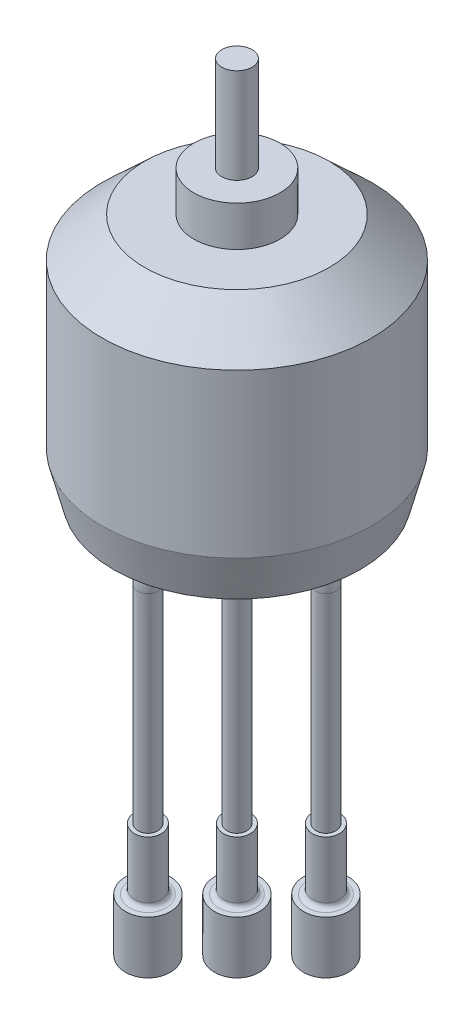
ISO-10303-21;
HEADER;
FILE_DESCRIPTION(('STEP AP214'),'2;1');
FILE_NAME('part.step','',(''),(''),'','','');
FILE_SCHEMA(('AUTOMOTIVE_DESIGN { 1 0 10303 214 1 1 1 1 }'));
ENDSEC;
DATA;
#1=APPLICATION_CONTEXT('core data for automotive mechanical design processes');
#2=APPLICATION_PROTOCOL_DEFINITION('international standard','automotive_design',2000,#1);
#3=PRODUCT_CONTEXT('',#1,'mechanical');
#4=PRODUCT('Part','Part','',(#3));
#5=PRODUCT_RELATED_PRODUCT_CATEGORY('part','',(#4));
#6=PRODUCT_DEFINITION_FORMATION('','',#4);
#7=PRODUCT_DEFINITION_CONTEXT('part definition',#1,'design');
#8=PRODUCT_DEFINITION('design','',#6,#7);
#9=PRODUCT_DEFINITION_SHAPE('','',#8);
#10=(LENGTH_UNIT() NAMED_UNIT(*) SI_UNIT(.MILLI.,.METRE.));
#11=(NAMED_UNIT(*) PLANE_ANGLE_UNIT() SI_UNIT($,.RADIAN.));
#12=(NAMED_UNIT(*) SI_UNIT($,.STERADIAN.) SOLID_ANGLE_UNIT());
#13=UNCERTAINTY_MEASURE_WITH_UNIT(LENGTH_MEASURE(1.E-05),#10,'distance_accuracy_value','');
#14=(GEOMETRIC_REPRESENTATION_CONTEXT(3) GLOBAL_UNCERTAINTY_ASSIGNED_CONTEXT((#13)) GLOBAL_UNIT_ASSIGNED_CONTEXT((#10,
#11,#12)) REPRESENTATION_CONTEXT('',''));
#15=CARTESIAN_POINT('',(0.,0.,0.));
#16=DIRECTION('',(0.,0.,1.));
#17=DIRECTION('',(1.,0.,0.));
#18=AXIS2_PLACEMENT_3D('',#15,#16,#17);
#19=CARTESIAN_POINT('',(-24.2896753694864,-53.4481047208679,-15.0972872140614));
#20=DIRECTION('',(-0.0859425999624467,-0.992586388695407,-0.0859425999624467));
#21=DIRECTION('',(0.,0.0862617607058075,-0.99627250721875));
#22=AXIS2_PLACEMENT_3D('',#19,#20,#21);
#23=PLANE('',#22);
#24=CARTESIAN_POINT('',(-24.2896753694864,-53.4481047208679,-15.0972872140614));
#25=DIRECTION('',(-0.0859425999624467,-0.992586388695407,-0.0859425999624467));
#26=DIRECTION('',(0.,0.0862617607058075,-0.99627250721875));
#27=AXIS2_PLACEMENT_3D('',#24,#25,#26);
#28=CIRCLE('',#27,2.);
#29=CARTESIAN_POINT('',(-24.2896753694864,-53.2755811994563,-17.0898322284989));
#30=VERTEX_POINT('',#29);
#31=EDGE_CURVE('E52',#30,#30,#28,.T.);
#32=ORIENTED_EDGE('',*,*,#31,.T.);
#33=EDGE_LOOP('',(#32));
#34=FACE_BOUND('',#33,.T.);
#35=CARTESIAN_POINT('',(-24.2896753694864,-53.4481047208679,-15.0972872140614));
#36=DIRECTION('',(-0.0859425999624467,-0.992586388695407,-0.0859425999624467));
#37=DIRECTION('',(0.,0.0862617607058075,-0.99627250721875));
#38=AXIS2_PLACEMENT_3D('',#35,#36,#37);
#39=CIRCLE('',#38,2.50000000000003);
#40=CARTESIAN_POINT('',(-24.2896753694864,-53.2324503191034,-17.5879684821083));
#41=VERTEX_POINT('',#40);
#42=EDGE_CURVE('E358',#41,#41,#39,.T.);
#43=ORIENTED_EDGE('',*,*,#42,.F.);
#44=EDGE_LOOP('',(#43));
#45=FACE_BOUND('',#44,.T.);
#46=ADVANCED_FACE('F44',(#34,#45),#23,.F.);
#47=CARTESIAN_POINT('',(-24.2896753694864,-53.4481047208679,-15.0972872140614));
#48=DIRECTION('',(-0.0859425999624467,-0.992586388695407,-0.0859425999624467));
#49=DIRECTION('',(0.,0.0862617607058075,-0.99627250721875));
#50=AXIS2_PLACEMENT_3D('',#47,#48,#49);
#51=CYLINDRICAL_SURFACE('',#50,2.50000000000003);
#52=ORIENTED_EDGE('',*,*,#42,.T.);
#53=EDGE_LOOP('',(#52));
#54=FACE_BOUND('',#53,.T.);
#55=CARTESIAN_POINT('',(-24.8053309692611,-59.4036230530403,-15.6129428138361));
#56=DIRECTION('',(-0.0859425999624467,-0.992586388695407,-0.0859425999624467));
#57=DIRECTION('',(0.,0.0862617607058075,-0.99627250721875));
#58=AXIS2_PLACEMENT_3D('',#55,#56,#57);
#59=CIRCLE('',#58,2.50000000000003);
#60=CARTESIAN_POINT('',(-24.8053309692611,-59.1879686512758,-18.103624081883));
#61=VERTEX_POINT('',#60);
#62=EDGE_CURVE('E361',#61,#61,#59,.T.);
#63=ORIENTED_EDGE('',*,*,#62,.F.);
#64=EDGE_LOOP('',(#63));
#65=FACE_BOUND('',#64,.T.);
#66=ADVANCED_FACE('F347',(#54,#65),#51,.T.);
#67=CARTESIAN_POINT('',(-24.8053309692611,-59.4036230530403,-15.6129428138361));
#68=DIRECTION('',(-0.0859425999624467,-0.992586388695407,-0.0859425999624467));
#69=DIRECTION('',(0.,0.0862617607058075,-0.99627250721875));
#70=AXIS2_PLACEMENT_3D('',#67,#68,#69);
#71=PLANE('',#70);
#72=ORIENTED_EDGE('',*,*,#62,.T.);
#73=EDGE_LOOP('',(#72));
#74=FACE_BOUND('',#73,.T.);
#75=ADVANCED_FACE('F343',(#74),#71,.T.);
#76=CARTESIAN_POINT('',(-23.6880771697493,-46.5,-14.4956890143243));
#77=DIRECTION('',(-0.0859425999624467,-0.992586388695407,-0.0859425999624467));
#78=DIRECTION('',(0.,0.0862617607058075,-0.99627250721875));
#79=AXIS2_PLACEMENT_3D('',#76,#77,#78);
#80=CYLINDRICAL_SURFACE('',#79,1.5);
#81=CARTESIAN_POINT('',(-24.2467040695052,-52.9518115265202,-15.0543159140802));
#82=DIRECTION('',(-0.0859425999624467,-0.992586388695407,-0.0859425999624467));
#83=DIRECTION('',(0.,0.0862617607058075,-0.99627250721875));
#84=AXIS2_PLACEMENT_3D('',#81,#82,#83);
#85=CIRCLE('',#84,1.5);
#86=CARTESIAN_POINT('',(-24.2467040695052,-52.8224188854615,-16.5487246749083));
#87=VERTEX_POINT('',#86);
#88=EDGE_CURVE('E364',#87,#87,#85,.F.);
#89=ORIENTED_EDGE('',*,*,#88,.T.);
#90=EDGE_LOOP('',(#89));
#91=FACE_BOUND('',#90,.T.);
#92=CARTESIAN_POINT('',(-23.6880771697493,-46.5,-14.4956890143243));
#93=DIRECTION('',(0.0859425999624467,0.992586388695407,0.0859425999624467));
#94=DIRECTION('',(0.,-0.0862617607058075,0.99627250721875));
#95=AXIS2_PLACEMENT_3D('',#92,#93,#94);
#96=CIRCLE('',#95,1.5);
#97=CARTESIAN_POINT('',(-23.6880771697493,-46.6293926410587,-13.0012802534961));
#98=VERTEX_POINT('',#97);
#99=EDGE_CURVE('E362',#98,#98,#96,.T.);
#100=ORIENTED_EDGE('',*,*,#99,.F.);
#101=EDGE_LOOP('',(#100));
#102=FACE_BOUND('',#101,.T.);
#103=ADVANCED_FACE('F339',(#91,#102),#80,.T.);
#104=CARTESIAN_POINT('',(-23.6880771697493,-46.5,-14.4956890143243));
#105=DIRECTION('',(0.0859425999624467,0.992586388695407,0.0859425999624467));
#106=DIRECTION('',(0.,-0.0862617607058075,0.99627250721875));
#107=AXIS2_PLACEMENT_3D('',#104,#105,#106);
#108=PLANE('',#107);
#109=CARTESIAN_POINT('',(-23.6880771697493,-46.5,-14.4956890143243));
#110=DIRECTION('',(0.0859425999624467,0.992586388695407,0.0859425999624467));
#111=DIRECTION('',(0.,-0.0862617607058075,0.99627250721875));
#112=AXIS2_PLACEMENT_3D('',#109,#110,#111);
#113=CIRCLE('',#112,1.1);
#114=CARTESIAN_POINT('',(-23.6880771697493,-46.5948879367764,-13.3997892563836));
#115=VERTEX_POINT('',#114);
#116=EDGE_CURVE('E12',#115,#115,#113,.T.);
#117=ORIENTED_EDGE('',*,*,#116,.F.);
#118=EDGE_LOOP('',(#117));
#119=FACE_BOUND('',#118,.T.);
#120=ORIENTED_EDGE('',*,*,#99,.T.);
#121=EDGE_LOOP('',(#120));
#122=FACE_BOUND('',#121,.T.);
#123=ADVANCED_FACE('F336',(#119,#122),#108,.T.);
#124=CARTESIAN_POINT('',(-24.2467040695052,-52.9518115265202,-15.0543159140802));
#125=DIRECTION('',(-0.0859425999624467,-0.992586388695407,-0.0859425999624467));
#126=DIRECTION('',(0.,0.0862617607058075,-0.99627250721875));
#127=AXIS2_PLACEMENT_3D('',#124,#125,#126);
#128=TOROIDAL_SURFACE('',#127,2.,0.5);
#129=ORIENTED_EDGE('',*,*,#31,.F.);
#130=EDGE_LOOP('',(#129));
#131=FACE_BOUND('',#130,.T.);
#132=ORIENTED_EDGE('',*,*,#88,.F.);
#133=EDGE_LOOP('',(#132));
#134=FACE_BOUND('',#133,.T.);
#135=ADVANCED_FACE('F46',(#131,#134),#128,.F.);
#136=CARTESIAN_POINT('',(-21.6568316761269,-23.0403114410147,-12.4644435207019));
#137=DIRECTION('',(-0.0859425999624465,-0.992586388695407,-0.0859425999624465));
#138=DIRECTION('',(0.,0.0862617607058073,-0.99627250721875));
#139=AXIS2_PLACEMENT_3D('',#136,#137,#138);
#140=CYLINDRICAL_SURFACE('',#139,1.1);
#141=CARTESIAN_POINT('',(-21.6568316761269,-23.0403114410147,-12.4644435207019));
#142=DIRECTION('',(-0.0859425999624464,-0.992586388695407,-0.0859425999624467));
#143=DIRECTION('',(-0.574716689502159,-0.0210715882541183,0.818081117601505));
#144=AXIS2_PLACEMENT_3D('',#141,#142,#143);
#145=CIRCLE('',#144,1.1);
#146=CARTESIAN_POINT('',(-21.2092097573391,-23.1653924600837,-11.4674533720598));
#147=VERTEX_POINT('',#146);
#148=EDGE_CURVE('E367',#147,#147,#145,.T.);
#149=ORIENTED_EDGE('',*,*,#148,.T.);
#150=EDGE_LOOP('',(#149));
#151=FACE_BOUND('',#150,.T.);
#152=ORIENTED_EDGE('',*,*,#116,.T.);
#153=EDGE_LOOP('',(#152));
#154=FACE_BOUND('',#153,.T.);
#155=ADVANCED_FACE('F331',(#151,#154),#140,.T.);
#156=CARTESIAN_POINT('',(-24.9122638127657,-22.1306313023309,-19.7152809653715));
#157=DIRECTION('',(0.909407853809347,-0.0429219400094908,-0.413684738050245));
#158=DIRECTION('',(-0.414066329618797,0.,-0.910246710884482));
#159=AXIS2_PLACEMENT_3D('',#156,#157,#158);
#160=TOROIDAL_SURFACE('',#159,8.,1.1);
#161=CARTESIAN_POINT('',(-21.8062992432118,-18.5763379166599,-13.256180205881));
#162=DIRECTION('',(0.149139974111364,-0.894855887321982,0.420702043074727));
#163=DIRECTION('',(-0.584245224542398,0.263506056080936,0.767608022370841));
#164=AXIS2_PLACEMENT_3D('',#161,#162,#163);
#165=CIRCLE('',#164,1.1);
#166=CARTESIAN_POINT('',(-21.3792291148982,-18.0876225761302,-12.368053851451));
#167=VERTEX_POINT('',#166);
#168=EDGE_CURVE('E926',#167,#167,#165,.T.);
#169=CARTESIAN_POINT('',(-24.9122638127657,-22.1306313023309,-19.7152809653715));
#170=DIRECTION('',(0.909407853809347,-0.0429219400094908,-0.413684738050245));
#171=DIRECTION('',(-0.414066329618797,0.,-0.910246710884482));
#172=AXIS2_PLACEMENT_3D('',#169,#170,#171);
#173=CIRCLE('',#172,9.1);
#174=EDGE_CURVE('',#167,#147,#173,.T.);
#175=ORIENTED_EDGE('',*,*,#168,.T.);
#176=ORIENTED_EDGE('',*,*,#148,.F.);
#177=ORIENTED_EDGE('',*,*,#174,.T.);
#178=ORIENTED_EDGE('',*,*,#174,.F.);
#179=EDGE_LOOP('',(#175,#177,#176,#178));
#180=FACE_BOUND('',#179,.T.);
#181=ADVANCED_FACE('F327',(#180),#160,.T.);
#182=CARTESIAN_POINT('',(-23.3468923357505,-9.33261364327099,-17.6019678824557));
#183=DIRECTION('',(0.149139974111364,-0.894855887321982,0.420702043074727));
#184=DIRECTION('',(0.,-0.425460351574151,-0.904977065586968));
#185=AXIS2_PLACEMENT_3D('',#182,#183,#184);
#186=CYLINDRICAL_SURFACE('',#185,1.1);
#187=CARTESIAN_POINT('',(-23.3468923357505,-9.33261364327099,-17.6019678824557));
#188=DIRECTION('',(0.149139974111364,-0.894855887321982,0.420702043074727));
#189=DIRECTION('',(-0.584245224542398,0.263506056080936,0.767608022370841));
#190=AXIS2_PLACEMENT_3D('',#187,#188,#189);
#191=CIRCLE('',#190,1.1);
#192=CARTESIAN_POINT('',(-24.0825418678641,-9.77775615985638,-18.2880202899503));
#193=VERTEX_POINT('',#192);
#194=EDGE_CURVE('E923',#193,#193,#191,.T.);
#195=ORIENTED_EDGE('',*,*,#194,.T.);
#196=EDGE_LOOP('',(#195));
#197=FACE_BOUND('',#196,.T.);
#198=ORIENTED_EDGE('',*,*,#168,.F.);
#199=EDGE_LOOP('',(#198));
#200=FACE_BOUND('',#199,.T.);
#201=ADVANCED_FACE('F323',(#197,#200),#186,.T.);
#202=CARTESIAN_POINT('',(-17.9967139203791,-6.09521352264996,-12.6124958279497));
#203=DIRECTION('',(-0.728354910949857,0.188337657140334,0.658808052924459));
#204=DIRECTION('',(0.670812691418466,0.,0.741626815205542));
#205=AXIS2_PLACEMENT_3D('',#202,#203,#204);
#206=TOROIDAL_SURFACE('',#205,8.,1.1);
#207=CARTESIAN_POINT('',(-18.2974104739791,1.49721048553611,-15.1154299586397));
#208=DIRECTION('',(-0.684168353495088,-0.252640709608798,-0.68416835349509));
#209=DIRECTION('',(-0.707106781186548,0.,0.707106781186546));
#210=AXIS2_PLACEMENT_3D('',#207,#208,#209);
#211=CIRCLE('',#210,1.1);
#212=CARTESIAN_POINT('',(-18.3387562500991,2.54116878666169,-15.4595834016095));
#213=VERTEX_POINT('',#212);
#214=EDGE_CURVE('E920',#213,#213,#211,.T.);
#215=CARTESIAN_POINT('',(-17.9967139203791,-6.09521352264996,-12.6124958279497));
#216=DIRECTION('',(-0.728354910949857,0.188337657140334,0.658808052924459));
#217=DIRECTION('',(0.670812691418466,0.,0.741626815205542));
#218=AXIS2_PLACEMENT_3D('',#215,#216,#217);
#219=CIRCLE('',#218,9.1);
#220=EDGE_CURVE('',#213,#193,#219,.T.);
#221=ORIENTED_EDGE('',*,*,#214,.T.);
#222=ORIENTED_EDGE('',*,*,#194,.F.);
#223=ORIENTED_EDGE('',*,*,#220,.T.);
#224=ORIENTED_EDGE('',*,*,#220,.F.);
#225=EDGE_LOOP('',(#221,#223,#222,#224));
#226=FACE_BOUND('',#225,.T.);
#227=ADVANCED_FACE('F319',(#226),#206,.T.);
#228=CARTESIAN_POINT('',(-18.2974104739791,1.49721048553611,-15.1154299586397));
#229=DIRECTION('',(0.684168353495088,0.252640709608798,0.684168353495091));
#230=DIRECTION('',(0.707106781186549,0.,-0.707106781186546));
#231=AXIS2_PLACEMENT_3D('',#228,#229,#230);
#232=CYLINDRICAL_SURFACE('',#231,1.1);
#233=ORIENTED_EDGE('',*,*,#214,.F.);
#234=EDGE_LOOP('',(#233));
#235=FACE_BOUND('',#234,.T.);
#236=CARTESIAN_POINT('',(-11.0710760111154,4.16565642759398,-7.88909549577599));
#237=DIRECTION('',(-0.684168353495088,-0.252640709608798,-0.684168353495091));
#238=DIRECTION('',(-0.707106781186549,0.,0.707106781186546));
#239=AXIS2_PLACEMENT_3D('',#236,#237,#238);
#240=CIRCLE('',#239,1.1);
#241=CARTESIAN_POINT('',(-11.2675843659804,5.22997260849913,-8.08560385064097));
#242=VERTEX_POINT('',#241);
#243=CARTESIAN_POINT('',(-10.8745676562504,3.10134024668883,-7.69258714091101));
#244=VERTEX_POINT('',#243);
#245=EDGE_CURVE('E150',#242,#244,#240,.T.);
#246=ORIENTED_EDGE('',*,*,#245,.T.);
#247=DIRECTION('',(0.684168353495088,0.252640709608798,0.68416835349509));
#248=VECTOR('',#247,1.);
#249=CARTESIAN_POINT('',(-17.0320828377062,0.827573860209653,-13.8501023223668));
#250=LINE('',#249,#248);
#251=CARTESIAN_POINT('',(-17.0320828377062,0.827573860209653,-13.8501023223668));
#252=VERTEX_POINT('',#251);
#253=EDGE_CURVE('E846',#252,#244,#250,.T.);
#254=ORIENTED_EDGE('',*,*,#253,.F.);
#255=CARTESIAN_POINT('',(-17.2285911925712,1.8918900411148,-14.0466106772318));
#256=DIRECTION('',(-0.684168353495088,-0.252640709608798,-0.684168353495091));
#257=DIRECTION('',(-0.707106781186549,0.,0.707106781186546));
#258=AXIS2_PLACEMENT_3D('',#255,#256,#257);
#259=CIRCLE('',#258,1.1);
#260=CARTESIAN_POINT('',(-17.4250995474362,2.95620622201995,-14.2431190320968));
#261=VERTEX_POINT('',#260);
#262=EDGE_CURVE('E158',#252,#261,#259,.T.);
#263=ORIENTED_EDGE('',*,*,#262,.T.);
#264=DIRECTION('',(0.684168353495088,0.252640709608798,0.68416835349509));
#265=VECTOR('',#264,1.);
#266=CARTESIAN_POINT('',(-17.4250995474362,2.95620622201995,-14.2431190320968));
#267=LINE('',#266,#265);
#268=EDGE_CURVE('E137',#261,#242,#267,.T.);
#269=ORIENTED_EDGE('',*,*,#268,.T.);
#270=EDGE_LOOP('',(#246,#254,#263,#269));
#271=FACE_BOUND('',#270,.T.);
#272=ADVANCED_FACE('F155',(#235,#271),#232,.T.);
#273=CARTESIAN_POINT('',(-17.2285911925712,1.8918900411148,-14.0466106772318));
#274=DIRECTION('',(0.684168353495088,0.252640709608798,0.68416835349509));
#275=DIRECTION('',(0.707106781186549,0.,-0.707106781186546));
#276=AXIS2_PLACEMENT_3D('',#273,#274,#275);
#277=CYLINDRICAL_SURFACE('',#276,1.1);
#278=CARTESIAN_POINT('',(-10.7461116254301,3.1487748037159,-7.56413111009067));
#279=VERTEX_POINT('',#278);
#280=EDGE_CURVE('E59',#244,#279,#250,.T.);
#281=ORIENTED_EDGE('',*,*,#280,.F.);
#282=EDGE_CURVE('E145',#244,#242,#240,.T.);
#283=ORIENTED_EDGE('',*,*,#282,.T.);
#284=CARTESIAN_POINT('',(-11.14440958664,5.27545697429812,-7.96242907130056));
#285=VERTEX_POINT('',#284);
#286=EDGE_CURVE('E134',#242,#285,#267,.T.);
#287=ORIENTED_EDGE('',*,*,#286,.T.);
#288=CARTESIAN_POINT('',(-11.0498722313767,5.2589233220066,-8.08580385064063));
#289=CARTESIAN_POINT('',(-11.0694750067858,5.2643543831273,-8.06141751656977));
#290=CARTESIAN_POINT('',(-11.0888562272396,5.26852457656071,-8.03659303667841));
#291=CARTESIAN_POINT('',(-11.1270518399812,5.27433254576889,-7.98622644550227));
#292=CARTESIAN_POINT('',(-11.1458662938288,5.27597059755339,-7.96068441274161));
#293=CARTESIAN_POINT('',(-11.2012123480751,5.27707053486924,-7.88330681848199));
#294=CARTESIAN_POINT('',(-11.2367196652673,5.27273824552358,-7.83062887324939));
#295=CARTESIAN_POINT('',(-11.3039419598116,5.25409857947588,-7.72465149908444));
#296=CARTESIAN_POINT('',(-11.3356562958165,5.23978951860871,-7.67135196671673));
#297=CARTESIAN_POINT('',(-11.3945044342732,5.20159962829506,-7.56565506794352));
#298=CARTESIAN_POINT('',(-11.4216384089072,5.17771915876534,-7.51325766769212));
#299=CARTESIAN_POINT('',(-11.4708170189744,5.12082642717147,-7.41062141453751));
#300=CARTESIAN_POINT('',(-11.4928307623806,5.08776124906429,-7.36039708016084));
#301=CARTESIAN_POINT('',(-11.5310585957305,5.01338580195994,-7.26399310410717));
#302=CARTESIAN_POINT('',(-11.5472721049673,4.97207470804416,-7.21781386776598));
#303=CARTESIAN_POINT('',(-11.5734454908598,4.88257447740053,-7.13132199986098));
#304=CARTESIAN_POINT('',(-11.5834479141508,4.83443497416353,-7.09097094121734));
#305=CARTESIAN_POINT('',(-11.5971699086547,4.73233793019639,-7.01714869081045));
#306=CARTESIAN_POINT('',(-11.6008906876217,4.67838150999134,-6.98367617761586));
#307=CARTESIAN_POINT('',(-11.6019952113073,4.56745709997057,-6.92549954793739));
#308=CARTESIAN_POINT('',(-11.5995232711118,4.51058739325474,-6.90061084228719));
#309=CARTESIAN_POINT('',(-11.5886610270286,4.39435234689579,-6.85944332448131));
#310=CARTESIAN_POINT('',(-11.5802715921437,4.33498737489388,-6.84316324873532));
#311=CARTESIAN_POINT('',(-11.5581201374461,4.21694094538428,-6.8200564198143));
#312=CARTESIAN_POINT('',(-11.5444901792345,4.15827664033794,-6.81301473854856));
#313=CARTESIAN_POINT('',(-11.5122521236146,4.04193614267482,-6.80786096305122));
#314=CARTESIAN_POINT('',(-11.4936442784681,3.98425990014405,-6.80974841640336));
#315=CARTESIAN_POINT('',(-11.4520504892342,3.87179393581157,-6.8222645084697));
#316=CARTESIAN_POINT('',(-11.4290842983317,3.81699256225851,-6.83285440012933));
#317=CARTESIAN_POINT('',(-11.3792989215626,3.71150519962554,-6.8622616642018));
#318=CARTESIAN_POINT('',(-11.3524793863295,3.660819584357,-6.88107978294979));
#319=CARTESIAN_POINT('',(-11.2950832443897,3.56400521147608,-6.92666214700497));
#320=CARTESIAN_POINT('',(-11.2644455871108,3.51797979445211,-6.95356885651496));
#321=CARTESIAN_POINT('',(-11.2005274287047,3.43280781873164,-7.01425187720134));
#322=CARTESIAN_POINT('',(-11.1672465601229,3.39366221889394,-7.04802914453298));
#323=CARTESIAN_POINT('',(-11.0978672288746,3.32233061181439,-7.12236000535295));
#324=CARTESIAN_POINT('',(-11.0617173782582,3.29035732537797,-7.16306989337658));
#325=CARTESIAN_POINT('',(-10.9882528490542,3.23561672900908,-7.24934027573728));
#326=CARTESIAN_POINT('',(-10.9509380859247,3.21285008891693,-7.294901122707));
#327=CARTESIAN_POINT('',(-10.8754966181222,3.17692117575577,-7.39023035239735));
#328=CARTESIAN_POINT('',(-10.8373660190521,3.16390419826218,-7.44005051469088));
#329=CARTESIAN_POINT('',(-10.7618380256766,3.14846354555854,-7.54186400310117));
#330=CARTESIAN_POINT('',(-10.7244407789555,3.14604198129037,-7.59385776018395));
#331=CARTESIAN_POINT('',(-10.6515953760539,3.15192814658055,-7.69832417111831));
#332=CARTESIAN_POINT('',(-10.6161409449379,3.1601989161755,-7.75079455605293));
#333=CARTESIAN_POINT('',(-10.5481653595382,3.18723970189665,-7.85487855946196));
#334=CARTESIAN_POINT('',(-10.5156405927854,3.20599657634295,-7.90649316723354));
#335=CARTESIAN_POINT('',(-10.4718318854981,3.24004985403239,-7.97893194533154));
#336=CARTESIAN_POINT('',(-10.4589055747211,3.25134126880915,-8.00071869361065));
#337=CARTESIAN_POINT('',(-10.4339196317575,3.27572916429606,-8.04370997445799));
#338=CARTESIAN_POINT('',(-10.4218585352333,3.28882248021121,-8.06491545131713));
#339=CARTESIAN_POINT('',(-10.4102540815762,3.30279604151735,-8.08580385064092));
#340=B_SPLINE_CURVE_WITH_KNOTS('',3,(#288,#289,#290,#291,#292,#293,#294,#295,#296,#297,#298,
#299,#300,#301,#302,#303,#304,#305,#306,#307,#308,#309,#310,#311,#312,#313,#314,#315,#316,#317,
#318,#319,#320,#321,#322,#323,#324,#325,#326,#327,#328,#329,#330,#331,#332,#333,#334,#335,#336,
#337,#338,#339),.UNSPECIFIED.,.F.,.F.,(4,2,2,2,2,2,2,2,2,2,2,2,2,2,2,2,2,2,2,2,2,2,2,2,2,4),(0.,
0.0952086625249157,0.190406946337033,0.380453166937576,0.570531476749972,0.760602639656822,
0.951792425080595,1.14300134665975,1.33288558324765,1.52273330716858,1.70819816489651,
1.89363579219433,2.07467793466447,2.25571090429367,2.43594217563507,2.61618979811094,
2.79981930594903,2.98347438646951,3.17201261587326,3.36056456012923,3.55187338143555,
3.74322031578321,3.9339075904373,4.1243564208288,4.20749755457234,4.290494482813),.UNSPECIFIED.);
#341=EDGE_CURVE('E188',#285,#279,#340,.T.);
#342=ORIENTED_EDGE('',*,*,#341,.T.);
#343=EDGE_LOOP('',(#281,#283,#287,#342));
#344=FACE_BOUND('',#343,.T.);
#345=ADVANCED_FACE('F146',(#344),#277,.F.);
#346=CARTESIAN_POINT('',(-14.0466106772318,1.8918900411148,-17.2285911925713));
#347=DIRECTION('',(0.684168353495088,0.252640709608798,0.68416835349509));
#348=DIRECTION('',(0.707106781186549,0.,-0.707106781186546));
#349=AXIS2_PLACEMENT_3D('',#346,#347,#348);
#350=CYLINDRICAL_SURFACE('',#349,1.1);
#351=DIRECTION('',(0.684168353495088,0.252640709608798,0.68416835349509));
#352=VECTOR('',#351,1.);
#353=CARTESIAN_POINT('',(-14.2431190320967,2.95620622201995,-17.4250995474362));
#354=LINE('',#353,#352);
#355=CARTESIAN_POINT('',(-8.08560385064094,5.22997260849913,-11.2675843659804));
#356=VERTEX_POINT('',#355);
#357=CARTESIAN_POINT('',(-7.96242907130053,5.27545697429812,-11.14440958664));
#358=VERTEX_POINT('',#357);
#359=EDGE_CURVE('E842',#356,#358,#354,.T.);
#360=ORIENTED_EDGE('',*,*,#359,.F.);
#361=CARTESIAN_POINT('',(-7.88909549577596,4.16565642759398,-11.0710760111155));
#362=DIRECTION('',(-0.684168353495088,-0.252640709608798,-0.684168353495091));
#363=DIRECTION('',(-0.707106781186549,0.,0.707106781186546));
#364=AXIS2_PLACEMENT_3D('',#361,#362,#363);
#365=CIRCLE('',#364,1.1);
#366=CARTESIAN_POINT('',(-7.69258714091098,3.10134024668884,-10.8745676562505));
#367=VERTEX_POINT('',#366);
#368=EDGE_CURVE('E66',#356,#367,#365,.T.);
#369=ORIENTED_EDGE('',*,*,#368,.T.);
#370=DIRECTION('',(0.684168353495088,0.252640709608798,0.68416835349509));
#371=VECTOR('',#370,1.);
#372=CARTESIAN_POINT('',(-13.8501023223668,0.827573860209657,-17.0320828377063));
#373=LINE('',#372,#371);
#374=CARTESIAN_POINT('',(-7.56413111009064,3.14877480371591,-10.7461116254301));
#375=VERTEX_POINT('',#374);
#376=EDGE_CURVE('E838',#367,#375,#373,.T.);
#377=ORIENTED_EDGE('',*,*,#376,.T.);
#378=CARTESIAN_POINT('',(-8.08580385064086,3.30279604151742,-10.4102540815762));
#379=CARTESIAN_POINT('',(-8.06217360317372,3.28698707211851,-10.4233816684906));
#380=CARTESIAN_POINT('',(-8.03813520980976,3.27230551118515,-10.4370952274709));
#381=CARTESIAN_POINT('',(-7.98938531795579,3.24528393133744,-10.4655840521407));
#382=CARTESIAN_POINT('',(-7.96467389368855,3.2329436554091,-10.4803592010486));
#383=CARTESIAN_POINT('',(-7.88984460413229,3.19960795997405,-10.5260504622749));
#384=CARTESIAN_POINT('',(-7.83892859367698,3.18222878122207,-10.5583899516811));
#385=CARTESIAN_POINT('',(-7.7364584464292,3.15764538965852,-10.6257631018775));
#386=CARTESIAN_POINT('',(-7.68490420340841,3.15044289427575,-10.6607972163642));
#387=CARTESIAN_POINT('',(-7.58254408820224,3.14633504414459,-10.7325290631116));
#388=CARTESIAN_POINT('',(-7.53173821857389,3.14942972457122,-10.7692268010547));
#389=CARTESIAN_POINT('',(-7.43178979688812,3.16584519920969,-10.8436424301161));
#390=CARTESIAN_POINT('',(-7.38266871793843,3.17926703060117,-10.8813668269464));
#391=CARTESIAN_POINT('',(-7.28802311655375,3.21602534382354,-10.9565128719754));
#392=CARTESIAN_POINT('',(-7.24249931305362,3.23936380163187,-10.9939344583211));
#393=CARTESIAN_POINT('',(-7.15594123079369,3.29558188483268,-11.0679577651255));
#394=CARTESIAN_POINT('',(-7.11496069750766,3.32856174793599,-11.1045462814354));
#395=CARTESIAN_POINT('',(-7.03937793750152,3.40302540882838,-11.1755987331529));
#396=CARTESIAN_POINT('',(-7.00477540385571,3.444508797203,-11.2100627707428));
#397=CARTESIAN_POINT('',(-6.94328096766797,3.53461663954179,-11.2758946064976));
#398=CARTESIAN_POINT('',(-6.91635621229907,3.58320927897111,-11.3072752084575));
#399=CARTESIAN_POINT('',(-6.87104494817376,3.68627879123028,-11.3663262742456));
#400=CARTESIAN_POINT('',(-6.85265743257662,3.74075496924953,-11.3939971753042));
#401=CARTESIAN_POINT('',(-6.82551886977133,3.85268206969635,-11.4443159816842));
#402=CARTESIAN_POINT('',(-6.81655829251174,3.9100372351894,-11.4670637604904));
#403=CARTESIAN_POINT('',(-6.80798243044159,4.02711895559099,-11.5076924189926));
#404=CARTESIAN_POINT('',(-6.80836545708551,4.08684508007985,-11.5255741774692));
#405=CARTESIAN_POINT('',(-6.81842230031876,4.20533054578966,-11.5555639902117));
#406=CARTESIAN_POINT('',(-6.82785970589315,4.26407587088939,-11.567807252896));
#407=CARTESIAN_POINT('',(-6.85539846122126,4.38040728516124,-11.5868159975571));
#408=CARTESIAN_POINT('',(-6.87349936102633,4.43799343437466,-11.5935817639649));
#409=CARTESIAN_POINT('',(-6.91759776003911,4.550001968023,-11.6013873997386));
#410=CARTESIAN_POINT('',(-6.94354038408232,4.6044433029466,-11.6024661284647));
#411=CARTESIAN_POINT('',(-7.00249237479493,4.709151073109,-11.5989299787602));
#412=CARTESIAN_POINT('',(-7.03550223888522,4.75941721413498,-11.5943146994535));
#413=CARTESIAN_POINT('',(-7.1081220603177,4.85531434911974,-11.5793289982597));
#414=CARTESIAN_POINT('',(-7.14783285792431,4.90085411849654,-11.5688639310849));
#415=CARTESIAN_POINT('',(-7.23219876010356,4.98521775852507,-11.5423145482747));
#416=CARTESIAN_POINT('',(-7.27685442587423,5.02404086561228,-11.5262295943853));
#417=CARTESIAN_POINT('',(-7.37097016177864,5.09496437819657,-11.4882854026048));
#418=CARTESIAN_POINT('',(-7.42052414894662,5.12686658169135,-11.4662885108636));
#419=CARTESIAN_POINT('',(-7.52195875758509,5.18188186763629,-11.4172098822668));
#420=CARTESIAN_POINT('',(-7.57384006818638,5.20499232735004,-11.3901266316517));
#421=CARTESIAN_POINT('',(-7.6792816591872,5.24214273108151,-11.3310305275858));
#422=CARTESIAN_POINT('',(-7.73285551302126,5.25602550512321,-11.2989432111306));
#423=CARTESIAN_POINT('',(-7.83924423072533,5.27368770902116,-11.2310151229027));
#424=CARTESIAN_POINT('',(-7.89205986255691,5.27747820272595,-11.1951785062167));
#425=CARTESIAN_POINT('',(-7.96800872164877,5.27554199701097,-11.1404888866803));
#426=CARTESIAN_POINT('',(-7.99205993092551,5.27379000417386,-11.1226833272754));
#427=CARTESIAN_POINT('',(-8.03947060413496,5.26803663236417,-11.0866076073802));
#428=CARTESIAN_POINT('',(-8.0628311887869,5.26403913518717,-11.0683383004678));
#429=CARTESIAN_POINT('',(-8.08580385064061,5.25892332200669,-11.0498722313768));
#430=B_SPLINE_CURVE_WITH_KNOTS('',3,(#378,#379,#380,#381,#382,#383,#384,#385,#386,#387,#388,
#389,#390,#391,#392,#393,#394,#395,#396,#397,#398,#399,#400,#401,#402,#403,#404,#405,#406,#407,
#408,#409,#410,#411,#412,#413,#414,#415,#416,#417,#418,#419,#420,#421,#422,#423,#424,#425,#426,
#427,#428,#429),.UNSPECIFIED.,.F.,.F.,(4,2,2,2,2,2,2,2,2,2,2,2,2,2,2,2,2,2,2,2,2,2,2,2,2,4),(0.,
0.0938868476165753,0.187763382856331,0.375111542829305,0.562491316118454,0.749871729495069,
0.939109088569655,1.12838417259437,1.31970165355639,1.51100992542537,1.701486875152,
1.89194135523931,2.07806695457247,2.26415891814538,2.44552059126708,2.6268728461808,
2.80698430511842,2.98710844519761,3.17023492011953,3.35338219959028,3.54123187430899,
3.72913754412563,3.92016686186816,4.11098667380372,4.20083345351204,4.29052539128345),.UNSPECIFIED.);
#431=EDGE_CURVE('E165',#375,#358,#430,.T.);
#432=ORIENTED_EDGE('',*,*,#431,.T.);
#433=EDGE_LOOP('',(#360,#369,#377,#432));
#434=FACE_BOUND('',#433,.T.);
#435=ADVANCED_FACE('F213',(#434),#350,.F.);
#436=CARTESIAN_POINT('',(0.,1.65,0.));
#437=DIRECTION('',(0.,1.,0.));
#438=DIRECTION('',(0.,0.,1.));
#439=AXIS2_PLACEMENT_3D('',#436,#437,#438);
#440=CONICAL_SURFACE('',#439,12.75,0.255408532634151);
#441=CARTESIAN_POINT('',(0.,6.15,0.));
#442=DIRECTION('',(0.,-1.,0.));
#443=DIRECTION('',(0.,0.,-1.));
#444=AXIS2_PLACEMENT_3D('',#441,#442,#443);
#445=CIRCLE('',#444,13.925);
#446=CARTESIAN_POINT('',(0.,6.15,-13.925));
#447=VERTEX_POINT('',#446);
#448=EDGE_CURVE('E899',#447,#447,#445,.T.);
#449=ORIENTED_EDGE('',*,*,#448,.T.);
#450=EDGE_LOOP('',(#449));
#451=FACE_BOUND('',#450,.T.);
#452=CARTESIAN_POINT('',(0.,1.65,0.));
#453=DIRECTION('',(0.,-1.,0.));
#454=DIRECTION('',(0.,0.,-1.));
#455=AXIS2_PLACEMENT_3D('',#452,#453,#454);
#456=CIRCLE('',#455,12.75);
#457=CARTESIAN_POINT('',(0.,1.65,-12.75));
#458=VERTEX_POINT('',#457);
#459=EDGE_CURVE('E896',#458,#458,#456,.T.);
#460=ORIENTED_EDGE('',*,*,#459,.F.);
#461=EDGE_LOOP('',(#460));
#462=FACE_BOUND('',#461,.T.);
#463=CARTESIAN_POINT('',(0.672720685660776,6.26110759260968,0.672720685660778));
#464=DIRECTION('',(0.178643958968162,-0.967560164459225,0.178643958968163));
#465=DIRECTION('',(0.684168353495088,0.252640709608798,0.68416835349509));
#466=AXIS2_PLACEMENT_3D('',#463,#464,#465);
#467=ELLIPSE('',#466,14.4218539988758,13.921541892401);
#468=CARTESIAN_POINT('',(-10.6555251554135,2.66546165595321,-7.4735446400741));
#469=VERTEX_POINT('',#468);
#470=CARTESIAN_POINT('',(-7.47354464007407,2.66546165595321,-10.6555251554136));
#471=VERTEX_POINT('',#470);
#472=EDGE_CURVE('E203',#469,#471,#467,.T.);
#473=ORIENTED_EDGE('',*,*,#472,.T.);
#474=CARTESIAN_POINT('',(-8.17512583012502,2.85775684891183,-10.1917082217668));
#475=CARTESIAN_POINT('',(-8.14076185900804,2.83629800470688,-10.212090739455));
#476=CARTESIAN_POINT('',(-8.10583950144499,2.81651930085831,-10.2332509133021));
#477=CARTESIAN_POINT('',(-8.03507880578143,2.78044026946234,-10.2769493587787));
#478=CARTESIAN_POINT('',(-7.99924057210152,2.76413954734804,-10.2994874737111));
#479=CARTESIAN_POINT('',(-7.89080969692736,2.72069219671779,-10.3688025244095));
#480=CARTESIAN_POINT('',(-7.81713915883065,2.69889950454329,-10.417376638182));
#481=CARTESIAN_POINT('',(-7.66905130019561,2.67025049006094,-10.5176176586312));
#482=CARTESIAN_POINT('',(-7.59463386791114,2.6633964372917,-10.569285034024));
#483=CARTESIAN_POINT('',(-7.44704010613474,2.66466284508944,-10.6741952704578));
#484=CARTESIAN_POINT('',(-7.3738638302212,2.67278395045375,-10.7274381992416));
#485=CARTESIAN_POINT('',(-7.22991881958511,2.70381503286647,-10.8347257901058));
#486=CARTESIAN_POINT('',(-7.15918989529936,2.72690264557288,-10.8887723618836));
#487=CARTESIAN_POINT('',(-7.02311393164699,2.7872583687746,-10.9957370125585));
#488=CARTESIAN_POINT('',(-6.9577681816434,2.82452986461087,-11.0486548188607));
#489=CARTESIAN_POINT('',(-6.83339084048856,2.91290192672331,-11.1530896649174));
#490=CARTESIAN_POINT('',(-6.77448596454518,2.96422753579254,-11.2045674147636));
#491=CARTESIAN_POINT('',(-6.66627867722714,3.07894030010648,-11.3040696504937));
#492=CARTESIAN_POINT('',(-6.61697601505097,3.14232714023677,-11.3520942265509));
#493=CARTESIAN_POINT('',(-6.52992934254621,3.27919070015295,-11.4435505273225));
#494=CARTESIAN_POINT('',(-6.49215384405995,3.35263912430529,-11.4869945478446));
#495=CARTESIAN_POINT('',(-6.42958622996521,3.50763640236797,-11.5684569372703));
#496=CARTESIAN_POINT('',(-6.40479181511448,3.58918381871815,-11.6064762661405));
#497=CARTESIAN_POINT('',(-6.36994094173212,3.75536845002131,-11.6750927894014));
#498=CARTESIAN_POINT('',(-6.35946508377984,3.83983983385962,-11.7058782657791));
#499=CARTESIAN_POINT('',(-6.3525163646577,4.01152053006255,-11.7606254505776));
#500=CARTESIAN_POINT('',(-6.35604016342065,4.09872918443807,-11.7845887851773));
#501=CARTESIAN_POINT('',(-6.37675666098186,4.27029851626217,-11.8243141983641));
#502=CARTESIAN_POINT('',(-6.39349314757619,4.35465793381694,-11.8403214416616));
#503=CARTESIAN_POINT('',(-6.43951291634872,4.52100800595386,-11.864800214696));
#504=CARTESIAN_POINT('',(-6.46879570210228,4.60299875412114,-11.873272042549));
#505=CARTESIAN_POINT('',(-6.53867413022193,4.76198613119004,-11.8823380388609));
#506=CARTESIAN_POINT('',(-6.57921503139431,4.83900475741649,-11.8829696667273));
#507=CARTESIAN_POINT('',(-6.67023914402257,4.98654597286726,-11.8763190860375));
#508=CARTESIAN_POINT('',(-6.72072362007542,5.05706773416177,-11.86903587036));
#509=CARTESIAN_POINT('',(-6.83139943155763,5.19172526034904,-11.8462924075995));
#510=CARTESIAN_POINT('',(-6.89181116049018,5.25564426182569,-11.8306221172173));
#511=CARTESIAN_POINT('',(-7.01938489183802,5.37345604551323,-11.7911918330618));
#512=CARTESIAN_POINT('',(-7.08654760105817,5.42734777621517,-11.7674309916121));
#513=CARTESIAN_POINT('',(-7.22786222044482,5.52549075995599,-11.7113028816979));
#514=CARTESIAN_POINT('',(-7.30217032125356,5.56937186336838,-11.6786810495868));
#515=CARTESIAN_POINT('',(-7.45359871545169,5.64414700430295,-11.6058331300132));
#516=CARTESIAN_POINT('',(-7.53072042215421,5.67503441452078,-11.56560317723));
#517=CARTESIAN_POINT('',(-7.68659810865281,5.72335182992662,-11.4777943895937));
#518=CARTESIAN_POINT('',(-7.76536141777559,5.74057667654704,-11.4301159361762));
#519=CARTESIAN_POINT('',(-7.92096254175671,5.76022303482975,-11.3290977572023));
#520=CARTESIAN_POINT('',(-7.99780383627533,5.76267357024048,-11.2757693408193));
#521=CARTESIAN_POINT('',(-8.08984418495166,5.75651546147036,-11.2075724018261));
#522=CARTESIAN_POINT('',(-8.10708881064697,5.75495136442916,-11.1946001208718));
#523=CARTESIAN_POINT('',(-8.14130744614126,5.75102334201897,-11.1684696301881));
#524=CARTESIAN_POINT('',(-8.15828178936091,5.74866049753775,-11.1553116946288));
#525=CARTESIAN_POINT('',(-8.17512583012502,5.74589874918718,-11.1420587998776));
#526=B_SPLINE_CURVE_WITH_KNOTS('',3,(#474,#475,#476,#477,#478,#479,#480,#481,#482,#483,#484,
#485,#486,#487,#488,#489,#490,#491,#492,#493,#494,#495,#496,#497,#498,#499,#500,#501,#502,#503,
#504,#505,#506,#507,#508,#509,#510,#511,#512,#513,#514,#515,#516,#517,#518,#519,#520,#521,#522,
#523,#524,#525),.UNSPECIFIED.,.F.,.F.,(4,2,2,2,2,2,2,2,2,2,2,2,2,2,2,2,2,2,2,2,2,2,2,2,2,4),(0.,
0.13597101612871,0.271926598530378,0.543205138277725,0.814524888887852,1.08585632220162,
1.36046862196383,1.63514650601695,1.91450966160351,2.19386551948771,2.47245129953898,
2.75098771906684,3.02117696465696,3.2913017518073,3.55248713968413,3.81366219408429,
4.07358890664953,4.33354869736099,4.60034626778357,4.86717180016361,5.14266735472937,
5.41830325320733,5.69800366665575,5.97715443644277,6.04205201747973,6.10686212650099),.UNSPECIFIED.);
#527=CARTESIAN_POINT('',(-8.05289097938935,5.75881611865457,-11.2348714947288));
#528=VERTEX_POINT('',#527);
#529=EDGE_CURVE('E173',#471,#528,#526,.T.);
#530=ORIENTED_EDGE('',*,*,#529,.T.);
#531=CARTESIAN_POINT('',(0.714547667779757,9.58384078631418,0.71454766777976));
#532=DIRECTION('',(-0.178643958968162,0.967560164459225,-0.178643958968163));
#533=DIRECTION('',(0.684168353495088,0.252640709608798,0.684168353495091));
#534=AXIS2_PLACEMENT_3D('',#531,#532,#533);
#535=ELLIPSE('',#534,15.31854506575,14.7871256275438);
#536=CARTESIAN_POINT('',(-11.2348714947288,5.75881611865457,-8.05289097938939));
#537=VERTEX_POINT('',#536);
#538=EDGE_CURVE('E202',#528,#537,#535,.T.);
#539=ORIENTED_EDGE('',*,*,#538,.T.);
#540=CARTESIAN_POINT('',(-11.1420587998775,5.74589874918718,-8.17512583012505));
#541=CARTESIAN_POINT('',(-11.170402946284,5.75180677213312,-8.13910475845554));
#542=CARTESIAN_POINT('',(-11.1983155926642,5.75588416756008,-8.10247413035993));
#543=CARTESIAN_POINT('',(-11.2531013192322,5.76037883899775,-8.02823178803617));
#544=CARTESIAN_POINT('',(-11.2799745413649,5.76079661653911,-7.9906202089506));
#545=CARTESIAN_POINT('',(-11.3586746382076,5.75656965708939,-7.87681085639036));
#546=CARTESIAN_POINT('',(-11.4086989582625,5.74646868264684,-7.79948963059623));
#547=CARTESIAN_POINT('',(-11.5024921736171,5.71206430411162,-7.64427589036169));
#548=CARTESIAN_POINT('',(-11.5462608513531,5.68776040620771,-7.56638335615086));
#549=CARTESIAN_POINT('',(-11.6265640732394,5.62562916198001,-7.41226471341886));
#550=CARTESIAN_POINT('',(-11.6630982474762,5.58780112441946,-7.33603869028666));
#551=CARTESIAN_POINT('',(-11.7284815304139,5.49912651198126,-7.18684101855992));
#552=CARTESIAN_POINT('',(-11.7572527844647,5.44815740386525,-7.11390803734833));
#553=CARTESIAN_POINT('',(-11.8061024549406,5.33460447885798,-6.97442742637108));
#554=CARTESIAN_POINT('',(-11.8261800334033,5.27201954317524,-6.90788041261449));
#555=CARTESIAN_POINT('',(-11.8572108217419,5.13719987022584,-6.78386667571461));
#556=CARTESIAN_POINT('',(-11.8682214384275,5.06502925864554,-6.7263447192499));
#557=CARTESIAN_POINT('',(-11.8812115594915,4.91259533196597,-6.62199903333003));
#558=CARTESIAN_POINT('',(-11.8831932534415,4.83233398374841,-6.57517271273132));
#559=CARTESIAN_POINT('',(-11.878303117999,4.66844957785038,-6.49527189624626));
#560=CARTESIAN_POINT('',(-11.8716943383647,4.58499888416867,-6.46182795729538));
#561=CARTESIAN_POINT('',(-11.8503732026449,4.4149747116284,-6.40803123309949));
#562=CARTESIAN_POINT('',(-11.8356624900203,4.32840186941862,-6.38767579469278));
#563=CARTESIAN_POINT('',(-11.7992114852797,4.15741234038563,-6.36120678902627));
#564=CARTESIAN_POINT('',(-11.7777007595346,4.0730110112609,-6.35467535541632));
#565=CARTESIAN_POINT('',(-11.7281528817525,3.90615714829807,-6.35471174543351));
#566=CARTESIAN_POINT('',(-11.700115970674,3.82370454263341,-6.36127908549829));
#567=CARTESIAN_POINT('',(-11.638304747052,3.66326787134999,-6.38704875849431));
#568=CARTESIAN_POINT('',(-11.6045435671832,3.5852741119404,-6.40622245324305));
#569=CARTESIAN_POINT('',(-11.5320056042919,3.4356470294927,-6.45629342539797));
#570=CARTESIAN_POINT('',(-11.4932281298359,3.36401458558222,-6.48719232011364));
#571=CARTESIAN_POINT('',(-11.4102738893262,3.22701102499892,-6.56054789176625));
#572=CARTESIAN_POINT('',(-11.3659742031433,3.16187828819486,-6.60331052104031));
#573=CARTESIAN_POINT('',(-11.2737798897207,3.04198233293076,-6.69842589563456));
#574=CARTESIAN_POINT('',(-11.2258845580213,2.98722115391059,-6.75078052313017));
#575=CARTESIAN_POINT('',(-11.125756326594,2.8878448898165,-6.86529615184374));
#576=CARTESIAN_POINT('',(-11.073431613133,2.84363431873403,-6.92772835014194));
#577=CARTESIAN_POINT('',(-10.9670393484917,2.76910380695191,-7.05906097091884));
#578=CARTESIAN_POINT('',(-10.9129717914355,2.73878391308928,-7.12796141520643));
#579=CARTESIAN_POINT('',(-10.8037273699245,2.69273897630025,-7.27098028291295));
#580=CARTESIAN_POINT('',(-10.7485448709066,2.67718227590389,-7.34514876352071));
#581=CARTESIAN_POINT('',(-10.6391209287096,2.66188294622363,-7.49583426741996));
#582=CARTESIAN_POINT('',(-10.5848798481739,2.66214628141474,-7.57235216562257));
#583=CARTESIAN_POINT('',(-10.4796620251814,2.67854462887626,-7.724516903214));
#584=CARTESIAN_POINT('',(-10.4286532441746,2.69448361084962,-7.80016283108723));
#585=CARTESIAN_POINT('',(-10.3309404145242,2.74157283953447,-7.94929766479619));
#586=CARTESIAN_POINT('',(-10.2842273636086,2.77269037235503,-8.02279085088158));
#587=CARTESIAN_POINT('',(-10.2237822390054,2.82548404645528,-8.12150187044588));
#588=CARTESIAN_POINT('',(-10.2075022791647,2.84111802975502,-8.1484961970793));
#589=CARTESIAN_POINT('',(-10.1917082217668,2.85775684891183,-8.17512583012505));
#590=B_SPLINE_CURVE_WITH_KNOTS('',3,(#540,#541,#542,#543,#544,#545,#546,#547,#548,#549,#550,
#551,#552,#553,#554,#555,#556,#557,#558,#559,#560,#561,#562,#563,#564,#565,#566,#567,#568,#569,
#570,#571,#572,#573,#574,#575,#576,#577,#578,#579,#580,#581,#582,#583,#584,#585,#586,#587,#588,
#589),.UNSPECIFIED.,.F.,.F.,(4,2,2,2,2,2,2,2,2,2,2,2,2,2,2,2,2,2,2,2,2,2,2,2,4),(0.,
0.138556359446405,0.277093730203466,0.553603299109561,0.830122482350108,1.10665580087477,
1.38586727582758,1.66510565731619,1.94256216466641,2.21995138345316,2.4890434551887,
2.75808096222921,3.01886262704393,3.27963466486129,3.53981633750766,3.80003391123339,
4.06771162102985,4.33544191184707,4.61220243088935,4.88896388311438,5.16884457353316,
5.44883078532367,5.7253596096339,6.00129505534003,6.10677462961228),.UNSPECIFIED.);
#591=EDGE_CURVE('E195',#537,#469,#590,.T.);
#592=ORIENTED_EDGE('',*,*,#591,.T.);
#593=EDGE_LOOP('',(#473,#530,#539,#592));
#594=FACE_BOUND('',#593,.T.);
#595=ADVANCED_FACE('F220',(#451,#462,#594),#440,.T.);
#596=CARTESIAN_POINT('',(1.57,0.,0.));
#597=DIRECTION('',(0.,-1.,0.));
#598=DIRECTION('',(0.,0.,-1.));
#599=AXIS2_PLACEMENT_3D('',#596,#597,#598);
#600=PLANE('',#599);
#601=CARTESIAN_POINT('',(0.,0.,0.));
#602=DIRECTION('',(0.,-1.,0.));
#603=DIRECTION('',(0.,0.,-1.));
#604=AXIS2_PLACEMENT_3D('',#601,#602,#603);
#605=CIRCLE('',#604,1.57);
#606=CARTESIAN_POINT('',(0.,0.,-1.57));
#607=VERTEX_POINT('',#606);
#608=EDGE_CURVE('E890',#607,#607,#605,.T.);
#609=ORIENTED_EDGE('',*,*,#608,.T.);
#610=EDGE_LOOP('',(#609));
#611=FACE_BOUND('',#610,.T.);
#612=ADVANCED_FACE('F312',(#611),#600,.T.);
#613=CARTESIAN_POINT('',(0.,41.,0.));
#614=DIRECTION('',(0.,1.,0.));
#615=DIRECTION('',(0.,0.,1.));
#616=AXIS2_PLACEMENT_3D('',#613,#614,#615);
#617=PLANE('',#616);
#618=CARTESIAN_POINT('',(0.,41.,0.));
#619=DIRECTION('',(0.,-1.,0.));
#620=DIRECTION('',(0.,0.,-1.));
#621=AXIS2_PLACEMENT_3D('',#618,#619,#620);
#622=CIRCLE('',#621,1.57);
#623=CARTESIAN_POINT('',(0.,41.,-1.57));
#624=VERTEX_POINT('',#623);
#625=EDGE_CURVE('E917',#624,#624,#622,.T.);
#626=ORIENTED_EDGE('',*,*,#625,.F.);
#627=EDGE_LOOP('',(#626));
#628=FACE_BOUND('',#627,.T.);
#629=ADVANCED_FACE('F308',(#628),#617,.T.);
#630=CARTESIAN_POINT('',(0.,0.,0.));
#631=DIRECTION('',(0.,-1.,0.));
#632=DIRECTION('',(0.,0.,-1.));
#633=AXIS2_PLACEMENT_3D('',#630,#631,#632);
#634=CYLINDRICAL_SURFACE('',#633,1.57);
#635=ORIENTED_EDGE('',*,*,#625,.T.);
#636=EDGE_LOOP('',(#635));
#637=FACE_BOUND('',#636,.T.);
#638=CARTESIAN_POINT('',(0.,31.2,0.));
#639=DIRECTION('',(0.,-1.,0.));
#640=DIRECTION('',(0.,0.,-1.));
#641=AXIS2_PLACEMENT_3D('',#638,#639,#640);
#642=CIRCLE('',#641,1.57);
#643=CARTESIAN_POINT('',(0.,31.2,-1.57));
#644=VERTEX_POINT('',#643);
#645=EDGE_CURVE('E914',#644,#644,#642,.T.);
#646=ORIENTED_EDGE('',*,*,#645,.F.);
#647=EDGE_LOOP('',(#646));
#648=FACE_BOUND('',#647,.T.);
#649=ADVANCED_FACE('F304',(#637,#648),#634,.T.);
#650=CARTESIAN_POINT('',(1.57,31.2,0.));
#651=DIRECTION('',(0.,1.,0.));
#652=DIRECTION('',(0.,0.,1.));
#653=AXIS2_PLACEMENT_3D('',#650,#651,#652);
#654=PLANE('',#653);
#655=ORIENTED_EDGE('',*,*,#645,.T.);
#656=EDGE_LOOP('',(#655));
#657=FACE_BOUND('',#656,.T.);
#658=CARTESIAN_POINT('',(0.,31.2,0.));
#659=DIRECTION('',(0.,-1.,0.));
#660=DIRECTION('',(0.,0.,-1.));
#661=AXIS2_PLACEMENT_3D('',#658,#659,#660);
#662=CIRCLE('',#661,4.45);
#663=CARTESIAN_POINT('',(0.,31.2,-4.45));
#664=VERTEX_POINT('',#663);
#665=EDGE_CURVE('E911',#664,#664,#662,.T.);
#666=ORIENTED_EDGE('',*,*,#665,.F.);
#667=EDGE_LOOP('',(#666));
#668=FACE_BOUND('',#667,.T.);
#669=ADVANCED_FACE('F300',(#657,#668),#654,.T.);
#670=CARTESIAN_POINT('',(0.,0.,0.));
#671=DIRECTION('',(0.,-1.,0.));
#672=DIRECTION('',(0.,0.,-1.));
#673=AXIS2_PLACEMENT_3D('',#670,#671,#672);
#674=CYLINDRICAL_SURFACE('',#673,4.45);
#675=ORIENTED_EDGE('',*,*,#665,.T.);
#676=EDGE_LOOP('',(#675));
#677=FACE_BOUND('',#676,.T.);
#678=CARTESIAN_POINT('',(0.,27.05,0.));
#679=DIRECTION('',(0.,-1.,0.));
#680=DIRECTION('',(0.,0.,-1.));
#681=AXIS2_PLACEMENT_3D('',#678,#679,#680);
#682=CIRCLE('',#681,4.45);
#683=CARTESIAN_POINT('',(0.,27.05,-4.45));
#684=VERTEX_POINT('',#683);
#685=EDGE_CURVE('E908',#684,#684,#682,.T.);
#686=ORIENTED_EDGE('',*,*,#685,.F.);
#687=EDGE_LOOP('',(#686));
#688=FACE_BOUND('',#687,.T.);
#689=ADVANCED_FACE('F296',(#677,#688),#674,.T.);
#690=CARTESIAN_POINT('',(4.45,27.05,0.));
#691=DIRECTION('',(0.,1.,0.));
#692=DIRECTION('',(0.,0.,1.));
#693=AXIS2_PLACEMENT_3D('',#690,#691,#692);
#694=PLANE('',#693);
#695=ORIENTED_EDGE('',*,*,#685,.T.);
#696=EDGE_LOOP('',(#695));
#697=FACE_BOUND('',#696,.T.);
#698=CARTESIAN_POINT('',(0.,27.05,0.));
#699=DIRECTION('',(0.,-1.,0.));
#700=DIRECTION('',(0.,0.,-1.));
#701=AXIS2_PLACEMENT_3D('',#698,#699,#700);
#702=CIRCLE('',#701,9.525);
#703=CARTESIAN_POINT('',(0.,27.05,-9.525));
#704=VERTEX_POINT('',#703);
#705=EDGE_CURVE('E905',#704,#704,#702,.T.);
#706=ORIENTED_EDGE('',*,*,#705,.F.);
#707=EDGE_LOOP('',(#706));
#708=FACE_BOUND('',#707,.T.);
#709=ADVANCED_FACE('F292',(#697,#708),#694,.T.);
#710=CARTESIAN_POINT('',(0.,22.95,0.));
#711=DIRECTION('',(0.,-1.,0.));
#712=DIRECTION('',(0.,0.,-1.));
#713=AXIS2_PLACEMENT_3D('',#710,#711,#712);
#714=CONICAL_SURFACE('',#713,13.925,0.82067763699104);
#715=ORIENTED_EDGE('',*,*,#705,.T.);
#716=EDGE_LOOP('',(#715));
#717=FACE_BOUND('',#716,.T.);
#718=CARTESIAN_POINT('',(0.,22.95,0.));
#719=DIRECTION('',(0.,-1.,0.));
#720=DIRECTION('',(0.,0.,-1.));
#721=AXIS2_PLACEMENT_3D('',#718,#719,#720);
#722=CIRCLE('',#721,13.925);
#723=CARTESIAN_POINT('',(0.,22.95,-13.925));
#724=VERTEX_POINT('',#723);
#725=EDGE_CURVE('E902',#724,#724,#722,.T.);
#726=ORIENTED_EDGE('',*,*,#725,.F.);
#727=EDGE_LOOP('',(#726));
#728=FACE_BOUND('',#727,.T.);
#729=ADVANCED_FACE('F288',(#717,#728),#714,.T.);
#730=CARTESIAN_POINT('',(0.,0.,0.));
#731=DIRECTION('',(0.,-1.,0.));
#732=DIRECTION('',(0.,0.,-1.));
#733=AXIS2_PLACEMENT_3D('',#730,#731,#732);
#734=CYLINDRICAL_SURFACE('',#733,13.925);
#735=ORIENTED_EDGE('',*,*,#725,.T.);
#736=EDGE_LOOP('',(#735));
#737=FACE_BOUND('',#736,.T.);
#738=ORIENTED_EDGE('',*,*,#448,.F.);
#739=EDGE_LOOP('',(#738));
#740=FACE_BOUND('',#739,.T.);
#741=ADVANCED_FACE('F280',(#737,#740),#734,.T.);
#742=CARTESIAN_POINT('',(12.75,1.65,0.));
#743=DIRECTION('',(0.,-1.,0.));
#744=DIRECTION('',(0.,0.,-1.));
#745=AXIS2_PLACEMENT_3D('',#742,#743,#744);
#746=PLANE('',#745);
#747=CARTESIAN_POINT('',(0.,1.65,8.));
#748=DIRECTION('',(0.,-1.,0.));
#749=DIRECTION('',(0.,0.,-1.));
#750=AXIS2_PLACEMENT_3D('',#747,#748,#749);
#751=CIRCLE('',#750,1.24999999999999);
#752=CARTESIAN_POINT('',(0.,1.65,6.75000000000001));
#753=VERTEX_POINT('',#752);
#754=EDGE_CURVE('E866',#753,#753,#751,.T.);
#755=ORIENTED_EDGE('',*,*,#754,.F.);
#756=EDGE_LOOP('',(#755));
#757=FACE_BOUND('',#756,.T.);
#758=CARTESIAN_POINT('',(0.,1.65,-8.));
#759=DIRECTION('',(0.,-1.,0.));
#760=DIRECTION('',(0.,0.,-1.));
#761=AXIS2_PLACEMENT_3D('',#758,#759,#760);
#762=CIRCLE('',#761,1.24999999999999);
#763=CARTESIAN_POINT('',(0.,1.65,-9.24999999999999));
#764=VERTEX_POINT('',#763);
#765=EDGE_CURVE('E872',#764,#764,#762,.T.);
#766=ORIENTED_EDGE('',*,*,#765,.F.);
#767=EDGE_LOOP('',(#766));
#768=FACE_BOUND('',#767,.T.);
#769=CARTESIAN_POINT('',(9.5,1.65,0.));
#770=DIRECTION('',(0.,-1.,0.));
#771=DIRECTION('',(0.,0.,-1.));
#772=AXIS2_PLACEMENT_3D('',#769,#770,#771);
#773=CIRCLE('',#772,1.24999999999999);
#774=CARTESIAN_POINT('',(9.5,1.65,-1.24999999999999));
#775=VERTEX_POINT('',#774);
#776=EDGE_CURVE('E878',#775,#775,#773,.T.);
#777=ORIENTED_EDGE('',*,*,#776,.F.);
#778=EDGE_LOOP('',(#777));
#779=FACE_BOUND('',#778,.T.);
#780=CARTESIAN_POINT('',(-9.5,1.65,0.));
#781=DIRECTION('',(0.,-1.,0.));
#782=DIRECTION('',(0.,0.,-1.));
#783=AXIS2_PLACEMENT_3D('',#780,#781,#782);
#784=CIRCLE('',#783,1.24999999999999);
#785=CARTESIAN_POINT('',(-9.5,1.65,-1.24999999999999));
#786=VERTEX_POINT('',#785);
#787=EDGE_CURVE('E884',#786,#786,#784,.T.);
#788=ORIENTED_EDGE('',*,*,#787,.F.);
#789=EDGE_LOOP('',(#788));
#790=FACE_BOUND('',#789,.T.);
#791=ORIENTED_EDGE('',*,*,#459,.T.);
#792=EDGE_LOOP('',(#791));
#793=FACE_BOUND('',#792,.T.);
#794=CARTESIAN_POINT('',(0.,1.65,0.));
#795=DIRECTION('',(0.,-1.,0.));
#796=DIRECTION('',(0.,0.,-1.));
#797=AXIS2_PLACEMENT_3D('',#794,#795,#796);
#798=CIRCLE('',#797,1.57000000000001);
#799=CARTESIAN_POINT('',(0.,1.65,-1.57000000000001));
#800=VERTEX_POINT('',#799);
#801=EDGE_CURVE('E893',#800,#800,#798,.T.);
#802=ORIENTED_EDGE('',*,*,#801,.F.);
#803=EDGE_LOOP('',(#802));
#804=FACE_BOUND('',#803,.T.);
#805=ADVANCED_FACE('F276',(#757,#768,#779,#790,#793,#804),#746,.T.);
#806=CARTESIAN_POINT('',(0.,0.,0.));
#807=DIRECTION('',(0.,-1.,0.));
#808=DIRECTION('',(0.,0.,-1.));
#809=AXIS2_PLACEMENT_3D('',#806,#807,#808);
#810=CYLINDRICAL_SURFACE('',#809,1.57);
#811=ORIENTED_EDGE('',*,*,#801,.T.);
#812=EDGE_LOOP('',(#811));
#813=FACE_BOUND('',#812,.T.);
#814=ORIENTED_EDGE('',*,*,#608,.F.);
#815=EDGE_LOOP('',(#814));
#816=FACE_BOUND('',#815,.T.);
#817=ADVANCED_FACE('F272',(#813,#816),#810,.T.);
#818=CARTESIAN_POINT('',(-9.5,6.65,0.));
#819=DIRECTION('',(0.,-1.,0.));
#820=DIRECTION('',(0.,0.,-1.));
#821=AXIS2_PLACEMENT_3D('',#818,#819,#820);
#822=CONICAL_SURFACE('',#821,1.24999999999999,1.0471975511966);
#823=CARTESIAN_POINT('',(-9.5,7.37168783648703,0.));
#824=VERTEX_POINT('',#823);
#825=VERTEX_LOOP('',#824);
#826=FACE_BOUND('',#825,.T.);
#827=CARTESIAN_POINT('',(-9.5,6.65,0.));
#828=DIRECTION('',(0.,-1.,0.));
#829=DIRECTION('',(0.,0.,-1.));
#830=AXIS2_PLACEMENT_3D('',#827,#828,#829);
#831=CIRCLE('',#830,1.24999999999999);
#832=CARTESIAN_POINT('',(-9.5,6.65,-1.24999999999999));
#833=VERTEX_POINT('',#832);
#834=EDGE_CURVE('E887',#833,#833,#831,.T.);
#835=ORIENTED_EDGE('',*,*,#834,.T.);
#836=EDGE_LOOP('',(#835));
#837=FACE_BOUND('',#836,.T.);
#838=ADVANCED_FACE('F268',(#826,#837),#822,.F.);
#839=CARTESIAN_POINT('',(-9.5,1.65,0.));
#840=DIRECTION('',(0.,-1.,0.));
#841=DIRECTION('',(0.,0.,-1.));
#842=AXIS2_PLACEMENT_3D('',#839,#840,#841);
#843=CYLINDRICAL_SURFACE('',#842,1.24999999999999);
#844=ORIENTED_EDGE('',*,*,#834,.F.);
#845=EDGE_LOOP('',(#844));
#846=FACE_BOUND('',#845,.T.);
#847=ORIENTED_EDGE('',*,*,#787,.T.);
#848=EDGE_LOOP('',(#847));
#849=FACE_BOUND('',#848,.T.);
#850=ADVANCED_FACE('F264',(#846,#849),#843,.F.);
#851=CARTESIAN_POINT('',(9.5,6.65,0.));
#852=DIRECTION('',(0.,-1.,0.));
#853=DIRECTION('',(0.,0.,-1.));
#854=AXIS2_PLACEMENT_3D('',#851,#852,#853);
#855=CONICAL_SURFACE('',#854,1.24999999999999,1.0471975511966);
#856=CARTESIAN_POINT('',(9.5,7.37168783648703,0.));
#857=VERTEX_POINT('',#856);
#858=VERTEX_LOOP('',#857);
#859=FACE_BOUND('',#858,.T.);
#860=CARTESIAN_POINT('',(9.5,6.65,0.));
#861=DIRECTION('',(0.,-1.,0.));
#862=DIRECTION('',(0.,0.,-1.));
#863=AXIS2_PLACEMENT_3D('',#860,#861,#862);
#864=CIRCLE('',#863,1.24999999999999);
#865=CARTESIAN_POINT('',(9.5,6.65,-1.24999999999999));
#866=VERTEX_POINT('',#865);
#867=EDGE_CURVE('E881',#866,#866,#864,.T.);
#868=ORIENTED_EDGE('',*,*,#867,.T.);
#869=EDGE_LOOP('',(#868));
#870=FACE_BOUND('',#869,.T.);
#871=ADVANCED_FACE('F260',(#859,#870),#855,.F.);
#872=CARTESIAN_POINT('',(9.5,1.65,0.));
#873=DIRECTION('',(0.,-1.,0.));
#874=DIRECTION('',(0.,0.,-1.));
#875=AXIS2_PLACEMENT_3D('',#872,#873,#874);
#876=CYLINDRICAL_SURFACE('',#875,1.24999999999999);
#877=ORIENTED_EDGE('',*,*,#867,.F.);
#878=EDGE_LOOP('',(#877));
#879=FACE_BOUND('',#878,.T.);
#880=ORIENTED_EDGE('',*,*,#776,.T.);
#881=EDGE_LOOP('',(#880));
#882=FACE_BOUND('',#881,.T.);
#883=ADVANCED_FACE('F256',(#879,#882),#876,.F.);
#884=CARTESIAN_POINT('',(0.,6.65,-8.));
#885=DIRECTION('',(0.,-1.,0.));
#886=DIRECTION('',(0.,0.,-1.));
#887=AXIS2_PLACEMENT_3D('',#884,#885,#886);
#888=CONICAL_SURFACE('',#887,1.24999999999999,1.0471975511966);
#889=CARTESIAN_POINT('',(0.,7.37168783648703,-8.));
#890=VERTEX_POINT('',#889);
#891=VERTEX_LOOP('',#890);
#892=FACE_BOUND('',#891,.T.);
#893=CARTESIAN_POINT('',(0.,6.65,-8.));
#894=DIRECTION('',(0.,-1.,0.));
#895=DIRECTION('',(0.,0.,-1.));
#896=AXIS2_PLACEMENT_3D('',#893,#894,#895);
#897=CIRCLE('',#896,1.24999999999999);
#898=CARTESIAN_POINT('',(0.,6.65,-9.24999999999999));
#899=VERTEX_POINT('',#898);
#900=EDGE_CURVE('E875',#899,#899,#897,.T.);
#901=ORIENTED_EDGE('',*,*,#900,.T.);
#902=EDGE_LOOP('',(#901));
#903=FACE_BOUND('',#902,.T.);
#904=ADVANCED_FACE('F252',(#892,#903),#888,.F.);
#905=CARTESIAN_POINT('',(0.,1.65,-8.));
#906=DIRECTION('',(0.,-1.,0.));
#907=DIRECTION('',(0.,0.,-1.));
#908=AXIS2_PLACEMENT_3D('',#905,#906,#907);
#909=CYLINDRICAL_SURFACE('',#908,1.24999999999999);
#910=ORIENTED_EDGE('',*,*,#900,.F.);
#911=EDGE_LOOP('',(#910));
#912=FACE_BOUND('',#911,.T.);
#913=ORIENTED_EDGE('',*,*,#765,.T.);
#914=EDGE_LOOP('',(#913));
#915=FACE_BOUND('',#914,.T.);
#916=ADVANCED_FACE('F248',(#912,#915),#909,.F.);
#917=CARTESIAN_POINT('',(0.,6.65,8.));
#918=DIRECTION('',(0.,-1.,0.));
#919=DIRECTION('',(0.,0.,-1.));
#920=AXIS2_PLACEMENT_3D('',#917,#918,#919);
#921=CONICAL_SURFACE('',#920,1.24999999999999,1.0471975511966);
#922=CARTESIAN_POINT('',(0.,7.37168783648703,8.));
#923=VERTEX_POINT('',#922);
#924=VERTEX_LOOP('',#923);
#925=FACE_BOUND('',#924,.T.);
#926=CARTESIAN_POINT('',(0.,6.65,8.));
#927=DIRECTION('',(0.,-1.,0.));
#928=DIRECTION('',(0.,0.,-1.));
#929=AXIS2_PLACEMENT_3D('',#926,#927,#928);
#930=CIRCLE('',#929,1.24999999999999);
#931=CARTESIAN_POINT('',(0.,6.65,6.75000000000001));
#932=VERTEX_POINT('',#931);
#933=EDGE_CURVE('E869',#932,#932,#930,.T.);
#934=ORIENTED_EDGE('',*,*,#933,.T.);
#935=EDGE_LOOP('',(#934));
#936=FACE_BOUND('',#935,.T.);
#937=ADVANCED_FACE('F244',(#925,#936),#921,.F.);
#938=CARTESIAN_POINT('',(0.,1.65,8.));
#939=DIRECTION('',(0.,-1.,0.));
#940=DIRECTION('',(0.,0.,-1.));
#941=AXIS2_PLACEMENT_3D('',#938,#939,#940);
#942=CYLINDRICAL_SURFACE('',#941,1.24999999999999);
#943=ORIENTED_EDGE('',*,*,#933,.F.);
#944=EDGE_LOOP('',(#943));
#945=FACE_BOUND('',#944,.T.);
#946=ORIENTED_EDGE('',*,*,#754,.T.);
#947=EDGE_LOOP('',(#946));
#948=FACE_BOUND('',#947,.T.);
#949=ADVANCED_FACE('F226',(#945,#948),#942,.F.);
#950=CARTESIAN_POINT('',(-14.0466106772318,1.8918900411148,-17.2285911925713));
#951=DIRECTION('',(-0.684168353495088,-0.252640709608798,-0.684168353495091));
#952=DIRECTION('',(-0.707106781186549,0.,0.707106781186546));
#953=AXIS2_PLACEMENT_3D('',#950,#951,#952);
#954=PLANE('',#953);
#955=CARTESIAN_POINT('',(-14.0466106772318,1.8918900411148,-17.2285911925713));
#956=DIRECTION('',(-0.684168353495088,-0.252640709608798,-0.684168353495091));
#957=DIRECTION('',(-0.707106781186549,0.,0.707106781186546));
#958=AXIS2_PLACEMENT_3D('',#955,#956,#957);
#959=CIRCLE('',#958,1.6);
#960=CARTESIAN_POINT('',(-14.3324410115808,3.43998630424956,-17.5144215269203));
#961=VERTEX_POINT('',#960);
#962=CARTESIAN_POINT('',(-13.7607803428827,0.343793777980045,-16.9427608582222));
#963=VERTEX_POINT('',#962);
#964=EDGE_CURVE('E837',#961,#963,#959,.T.);
#965=ORIENTED_EDGE('',*,*,#964,.T.);
#966=DIRECTION('',(-0.707106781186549,0.,0.707106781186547));
#967=VECTOR('',#966,1.);
#968=CARTESIAN_POINT('',(-13.7607803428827,0.343793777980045,-16.9427608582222));
#969=LINE('',#968,#967);
#970=CARTESIAN_POINT('',(-16.9427608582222,0.343793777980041,-13.7607803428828));
#971=VERTEX_POINT('',#970);
#972=EDGE_CURVE('E851',#963,#971,#969,.T.);
#973=ORIENTED_EDGE('',*,*,#972,.T.);
#974=CARTESIAN_POINT('',(-17.2285911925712,1.8918900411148,-14.0466106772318));
#975=DIRECTION('',(-0.684168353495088,-0.252640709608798,-0.684168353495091));
#976=DIRECTION('',(-0.707106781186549,0.,0.707106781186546));
#977=AXIS2_PLACEMENT_3D('',#974,#975,#976);
#978=CIRCLE('',#977,1.6);
#979=CARTESIAN_POINT('',(-17.5144215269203,3.43998630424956,-14.3324410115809));
#980=VERTEX_POINT('',#979);
#981=EDGE_CURVE('E853',#971,#980,#978,.T.);
#982=ORIENTED_EDGE('',*,*,#981,.T.);
#983=DIRECTION('',(0.707106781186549,0.,-0.707106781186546));
#984=VECTOR('',#983,1.);
#985=CARTESIAN_POINT('',(-14.3324410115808,3.43998630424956,-17.5144215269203));
#986=LINE('',#985,#984);
#987=EDGE_CURVE('E855',#980,#961,#986,.T.);
#988=ORIENTED_EDGE('',*,*,#987,.T.);
#989=EDGE_LOOP('',(#965,#973,#982,#988));
#990=FACE_BOUND('',#989,.T.);
#991=DIRECTION('',(-0.707106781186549,0.,0.707106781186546));
#992=VECTOR('',#991,1.);
#993=CARTESIAN_POINT('',(-13.8501023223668,0.827573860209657,-17.0320828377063));
#994=LINE('',#993,#992);
#995=CARTESIAN_POINT('',(-13.8501023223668,0.827573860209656,-17.0320828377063));
#996=VERTEX_POINT('',#995);
#997=EDGE_CURVE('E963',#996,#252,#994,.T.);
#998=ORIENTED_EDGE('',*,*,#997,.F.);
#999=CARTESIAN_POINT('',(-14.0466106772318,1.8918900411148,-17.2285911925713));
#1000=DIRECTION('',(-0.684168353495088,-0.252640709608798,-0.684168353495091));
#1001=DIRECTION('',(-0.707106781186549,0.,0.707106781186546));
#1002=AXIS2_PLACEMENT_3D('',#999,#1000,#1001);
#1003=CIRCLE('',#1002,1.1);
#1004=CARTESIAN_POINT('',(-14.2431190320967,2.95620622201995,-17.4250995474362));
#1005=VERTEX_POINT('',#1004);
#1006=EDGE_CURVE('E834',#1005,#996,#1003,.T.);
#1007=ORIENTED_EDGE('',*,*,#1006,.F.);
#1008=DIRECTION('',(0.707106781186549,0.,-0.707106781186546));
#1009=VECTOR('',#1008,1.);
#1010=CARTESIAN_POINT('',(-14.2431190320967,2.95620622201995,-17.4250995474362));
#1011=LINE('',#1010,#1009);
#1012=EDGE_CURVE('E966',#261,#1005,#1011,.T.);
#1013=ORIENTED_EDGE('',*,*,#1012,.F.);
#1014=ORIENTED_EDGE('',*,*,#262,.F.);
#1015=EDGE_LOOP('',(#998,#1007,#1013,#1014));
#1016=FACE_BOUND('',#1015,.T.);
#1017=ADVANCED_FACE('F222',(#990,#1016),#954,.T.);
#1018=CARTESIAN_POINT('',(-14.0466106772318,1.8918900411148,-17.2285911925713));
#1019=DIRECTION('',(0.684168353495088,0.252640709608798,0.68416835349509));
#1020=DIRECTION('',(0.707106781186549,0.,-0.707106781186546));
#1021=AXIS2_PLACEMENT_3D('',#1018,#1019,#1020);
#1022=CYLINDRICAL_SURFACE('',#1021,1.6);
#1023=DIRECTION('',(0.684168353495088,0.252640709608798,0.68416835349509));
#1024=VECTOR('',#1023,1.);
#1025=CARTESIAN_POINT('',(-14.3324410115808,3.43998630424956,-17.5144215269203));
#1026=LINE('',#1025,#1024);
#1027=EDGE_CURVE('E857',#961,#528,#1026,.T.);
#1028=ORIENTED_EDGE('',*,*,#1027,.T.);
#1029=ORIENTED_EDGE('',*,*,#529,.F.);
#1030=DIRECTION('',(0.684168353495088,0.252640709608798,0.68416835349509));
#1031=VECTOR('',#1030,1.);
#1032=CARTESIAN_POINT('',(-13.7607803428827,0.343793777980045,-16.9427608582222));
#1033=LINE('',#1032,#1031);
#1034=EDGE_CURVE('E864',#963,#471,#1033,.T.);
#1035=ORIENTED_EDGE('',*,*,#1034,.F.);
#1036=ORIENTED_EDGE('',*,*,#964,.F.);
#1037=EDGE_LOOP('',(#1028,#1029,#1035,#1036));
#1038=FACE_BOUND('',#1037,.T.);
#1039=ADVANCED_FACE('F225',(#1038),#1022,.T.);
#1040=CARTESIAN_POINT('',(-13.7607803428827,0.343793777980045,-16.9427608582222));
#1041=DIRECTION('',(-0.178643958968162,0.967560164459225,-0.178643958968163));
#1042=DIRECTION('',(0.,0.181564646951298,0.983379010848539));
#1043=AXIS2_PLACEMENT_3D('',#1040,#1041,#1042);
#1044=PLANE('',#1043);
#1045=ORIENTED_EDGE('',*,*,#1034,.T.);
#1046=ORIENTED_EDGE('',*,*,#472,.F.);
#1047=DIRECTION('',(0.684168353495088,0.252640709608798,0.68416835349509));
#1048=VECTOR('',#1047,1.);
#1049=CARTESIAN_POINT('',(-16.9427608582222,0.343793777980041,-13.7607803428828));
#1050=LINE('',#1049,#1048);
#1051=EDGE_CURVE('E862',#971,#469,#1050,.T.);
#1052=ORIENTED_EDGE('',*,*,#1051,.F.);
#1053=ORIENTED_EDGE('',*,*,#972,.F.);
#1054=EDGE_LOOP('',(#1045,#1046,#1052,#1053));
#1055=FACE_BOUND('',#1054,.T.);
#1056=ADVANCED_FACE('F234',(#1055),#1044,.F.);
#1057=CARTESIAN_POINT('',(-17.2285911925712,1.8918900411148,-14.0466106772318));
#1058=DIRECTION('',(0.684168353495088,0.252640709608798,0.68416835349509));
#1059=DIRECTION('',(0.707106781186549,0.,-0.707106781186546));
#1060=AXIS2_PLACEMENT_3D('',#1057,#1058,#1059);
#1061=CYLINDRICAL_SURFACE('',#1060,1.6);
#1062=ORIENTED_EDGE('',*,*,#1051,.T.);
#1063=ORIENTED_EDGE('',*,*,#591,.F.);
#1064=DIRECTION('',(0.684168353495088,0.252640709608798,0.68416835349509));
#1065=VECTOR('',#1064,1.);
#1066=CARTESIAN_POINT('',(-17.5144215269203,3.43998630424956,-14.3324410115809));
#1067=LINE('',#1066,#1065);
#1068=EDGE_CURVE('E859',#980,#537,#1067,.T.);
#1069=ORIENTED_EDGE('',*,*,#1068,.F.);
#1070=ORIENTED_EDGE('',*,*,#981,.F.);
#1071=EDGE_LOOP('',(#1062,#1063,#1069,#1070));
#1072=FACE_BOUND('',#1071,.T.);
#1073=ADVANCED_FACE('F230',(#1072),#1061,.T.);
#1074=CARTESIAN_POINT('',(-14.3324410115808,3.43998630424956,-17.5144215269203));
#1075=DIRECTION('',(0.178643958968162,-0.967560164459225,0.178643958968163));
#1076=DIRECTION('',(0.,-0.181564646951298,-0.983379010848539));
#1077=AXIS2_PLACEMENT_3D('',#1074,#1075,#1076);
#1078=PLANE('',#1077);
#1079=ORIENTED_EDGE('',*,*,#1068,.T.);
#1080=ORIENTED_EDGE('',*,*,#538,.F.);
#1081=ORIENTED_EDGE('',*,*,#1027,.F.);
#1082=ORIENTED_EDGE('',*,*,#987,.F.);
#1083=EDGE_LOOP('',(#1079,#1080,#1081,#1082));
#1084=FACE_BOUND('',#1083,.T.);
#1085=ADVANCED_FACE('F216',(#1084),#1078,.F.);
#1086=CARTESIAN_POINT('',(-13.8501023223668,0.827573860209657,-17.0320828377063));
#1087=DIRECTION('',(-0.178643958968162,0.967560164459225,-0.178643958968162));
#1088=DIRECTION('',(-0.983379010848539,-0.181564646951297,0.));
#1089=AXIS2_PLACEMENT_3D('',#1086,#1087,#1088);
#1090=PLANE('',#1089);
#1091=ORIENTED_EDGE('',*,*,#997,.T.);
#1092=ORIENTED_EDGE('',*,*,#253,.T.);
#1093=ORIENTED_EDGE('',*,*,#280,.T.);
#1094=CARTESIAN_POINT('',(0.679256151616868,6.78028465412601,0.679256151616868));
#1095=DIRECTION('',(0.178643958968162,-0.967560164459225,0.178643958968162));
#1096=DIRECTION('',(0.68416835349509,0.252640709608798,0.684168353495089));
#1097=AXIS2_PLACEMENT_3D('',#1094,#1095,#1096);
#1098=ELLIPSE('',#1097,14.5619619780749,14.0567893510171);
#1099=EDGE_CURVE('E845',#279,#375,#1098,.T.);
#1100=ORIENTED_EDGE('',*,*,#1099,.T.);
#1101=ORIENTED_EDGE('',*,*,#376,.F.);
#1102=EDGE_CURVE('E830',#996,#367,#373,.T.);
#1103=ORIENTED_EDGE('',*,*,#1102,.F.);
#1104=EDGE_LOOP('',(#1091,#1092,#1093,#1100,#1101,#1103));
#1105=FACE_BOUND('',#1104,.T.);
#1106=ADVANCED_FACE('F210',(#1105),#1090,.T.);
#1107=CARTESIAN_POINT('',(-14.2431190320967,2.95620622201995,-17.4250995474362));
#1108=DIRECTION('',(0.178643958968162,-0.967560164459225,0.178643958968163));
#1109=DIRECTION('',(0.,-0.181564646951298,-0.983379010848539));
#1110=AXIS2_PLACEMENT_3D('',#1107,#1108,#1109);
#1111=PLANE('',#1110);
#1112=ORIENTED_EDGE('',*,*,#1012,.T.);
#1113=EDGE_CURVE('E142',#1005,#356,#354,.T.);
#1114=ORIENTED_EDGE('',*,*,#1113,.T.);
#1115=ORIENTED_EDGE('',*,*,#359,.T.);
#1116=CARTESIAN_POINT('',(0.708012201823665,9.06466372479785,0.708012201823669));
#1117=DIRECTION('',(-0.178643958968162,0.967560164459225,-0.178643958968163));
#1118=DIRECTION('',(0.684168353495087,0.252640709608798,0.684168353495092));
#1119=AXIS2_PLACEMENT_3D('',#1116,#1117,#1118);
#1120=ELLIPSE('',#1119,15.1784370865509,14.6518781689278);
#1121=EDGE_CURVE('E140',#358,#285,#1120,.T.);
#1122=ORIENTED_EDGE('',*,*,#1121,.T.);
#1123=ORIENTED_EDGE('',*,*,#286,.F.);
#1124=ORIENTED_EDGE('',*,*,#268,.F.);
#1125=EDGE_LOOP('',(#1112,#1114,#1115,#1122,#1123,#1124));
#1126=FACE_BOUND('',#1125,.T.);
#1127=ADVANCED_FACE('F135',(#1126),#1111,.T.);
#1128=ORIENTED_EDGE('',*,*,#431,.F.);
#1129=ORIENTED_EDGE('',*,*,#1099,.F.);
#1130=ORIENTED_EDGE('',*,*,#341,.F.);
#1131=ORIENTED_EDGE('',*,*,#1121,.F.);
#1132=EDGE_LOOP('',(#1128,#1129,#1130,#1131));
#1133=FACE_BOUND('',#1132,.T.);
#1134=ADVANCED_FACE('F209',(#1133),#440,.T.);
#1135=CARTESIAN_POINT('',(-14.7307790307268,1.639249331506,-17.9127595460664));
#1136=DIRECTION('',(0.684168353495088,0.252640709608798,0.684168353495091));
#1137=DIRECTION('',(0.707106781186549,0.,-0.707106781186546));
#1138=AXIS2_PLACEMENT_3D('',#1135,#1136,#1137);
#1139=CYLINDRICAL_SURFACE('',#1138,1.1);
#1140=ORIENTED_EDGE('',*,*,#1102,.T.);
#1141=EDGE_CURVE('E160',#367,#356,#365,.T.);
#1142=ORIENTED_EDGE('',*,*,#1141,.T.);
#1143=ORIENTED_EDGE('',*,*,#1113,.F.);
#1144=ORIENTED_EDGE('',*,*,#1006,.T.);
#1145=EDGE_LOOP('',(#1140,#1142,#1143,#1144));
#1146=FACE_BOUND('',#1145,.T.);
#1147=CARTESIAN_POINT('',(-15.1154299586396,1.49721048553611,-18.2974104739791));
#1148=DIRECTION('',(-0.684168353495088,-0.252640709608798,-0.68416835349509));
#1149=DIRECTION('',(-0.707106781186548,0.,0.707106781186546));
#1150=AXIS2_PLACEMENT_3D('',#1147,#1148,#1149);
#1151=CIRCLE('',#1150,1.1);
#1152=CARTESIAN_POINT('',(-15.4595834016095,2.54116878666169,-18.3387562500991));
#1153=VERTEX_POINT('',#1152);
#1154=EDGE_CURVE('E791',#1153,#1153,#1151,.T.);
#1155=ORIENTED_EDGE('',*,*,#1154,.F.);
#1156=EDGE_LOOP('',(#1155));
#1157=FACE_BOUND('',#1156,.T.);
#1158=ADVANCED_FACE('F284',(#1146,#1157),#1139,.T.);
#1159=CARTESIAN_POINT('',(-7.88909549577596,4.16565642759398,-11.0710760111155));
#1160=DIRECTION('',(-0.684168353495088,-0.252640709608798,-0.684168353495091));
#1161=DIRECTION('',(-0.707106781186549,0.,0.707106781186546));
#1162=AXIS2_PLACEMENT_3D('',#1159,#1160,#1161);
#1163=PLANE('',#1162);
#1164=ORIENTED_EDGE('',*,*,#368,.F.);
#1165=ORIENTED_EDGE('',*,*,#1141,.F.);
#1166=EDGE_LOOP('',(#1164,#1165));
#1167=FACE_BOUND('',#1166,.T.);
#1168=ADVANCED_FACE('F535',(#1167),#1163,.F.);
#1169=CARTESIAN_POINT('',(-11.0710760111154,4.16565642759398,-7.88909549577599));
#1170=DIRECTION('',(-0.684168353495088,-0.252640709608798,-0.684168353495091));
#1171=DIRECTION('',(-0.707106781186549,0.,0.707106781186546));
#1172=AXIS2_PLACEMENT_3D('',#1169,#1170,#1171);
#1173=PLANE('',#1172);
#1174=ORIENTED_EDGE('',*,*,#245,.F.);
#1175=ORIENTED_EDGE('',*,*,#282,.F.);
#1176=EDGE_LOOP('',(#1174,#1175));
#1177=FACE_BOUND('',#1176,.T.);
#1178=ADVANCED_FACE('F159',(#1177),#1173,.F.);
#1179=CARTESIAN_POINT('',(-12.4644435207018,-23.0403114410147,-21.656831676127));
#1180=DIRECTION('',(-0.0859425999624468,-0.992586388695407,-0.0859425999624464));
#1181=DIRECTION('',(0.99627250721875,-0.0862617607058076,0.));
#1182=AXIS2_PLACEMENT_3D('',#1179,#1180,#1181);
#1183=CYLINDRICAL_SURFACE('',#1182,1.1);
#1184=CARTESIAN_POINT('',(-12.4644435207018,-23.0403114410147,-21.656831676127));
#1185=DIRECTION('',(-0.085942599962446,-0.992586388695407,-0.0859425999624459));
#1186=DIRECTION('',(-0.818081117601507,0.0210715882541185,0.574716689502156));
#1187=AXIS2_PLACEMENT_3D('',#1184,#1185,#1186);
#1188=CIRCLE('',#1187,1.1);
#1189=CARTESIAN_POINT('',(-11.4674533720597,-23.1653924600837,-21.2092097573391));
#1190=VERTEX_POINT('',#1189);
#1191=EDGE_CURVE('E805',#1190,#1190,#1188,.T.);
#1192=ORIENTED_EDGE('',*,*,#1191,.T.);
#1193=EDGE_LOOP('',(#1192));
#1194=FACE_BOUND('',#1193,.T.);
#1195=CARTESIAN_POINT('',(-14.4956890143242,-46.5,-23.6880771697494));
#1196=DIRECTION('',(-0.085942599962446,-0.992586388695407,-0.0859425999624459));
#1197=DIRECTION('',(-0.818081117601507,0.0210715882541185,0.574716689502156));
#1198=AXIS2_PLACEMENT_3D('',#1195,#1196,#1197);
#1199=CIRCLE('',#1198,1.1);
#1200=CARTESIAN_POINT('',(-15.3955782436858,-46.4768212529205,-23.055888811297));
#1201=VERTEX_POINT('',#1200);
#1202=EDGE_CURVE('E151',#1201,#1201,#1199,.T.);
#1203=ORIENTED_EDGE('',*,*,#1202,.F.);
#1204=EDGE_LOOP('',(#1203));
#1205=FACE_BOUND('',#1204,.T.);
#1206=ADVANCED_FACE('F547',(#1194,#1205),#1183,.T.);
#1207=CARTESIAN_POINT('',(-19.7152809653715,-22.1306313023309,-24.9122638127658));
#1208=DIRECTION('',(0.413684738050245,0.0429219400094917,-0.909407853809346));
#1209=DIRECTION('',(-0.910246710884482,0.,-0.414066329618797));
#1210=AXIS2_PLACEMENT_3D('',#1207,#1208,#1209);
#1211=TOROIDAL_SURFACE('',#1210,8.,1.1);
#1212=CARTESIAN_POINT('',(-13.2561802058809,-18.5763379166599,-21.8062992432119));
#1213=DIRECTION('',(0.420702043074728,-0.894855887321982,0.149139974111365));
#1214=DIRECTION('',(-0.767608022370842,-0.263506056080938,0.584245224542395));
#1215=AXIS2_PLACEMENT_3D('',#1212,#1213,#1214);
#1216=CIRCLE('',#1215,1.1);
#1217=CARTESIAN_POINT('',(-12.368053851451,-18.0876225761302,-21.3792291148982));
#1218=VERTEX_POINT('',#1217);
#1219=EDGE_CURVE('E803',#1218,#1218,#1216,.T.);
#1220=CARTESIAN_POINT('',(-19.7152809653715,-22.1306313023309,-24.9122638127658));
#1221=DIRECTION('',(0.413684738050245,0.0429219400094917,-0.909407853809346));
#1222=DIRECTION('',(-0.910246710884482,0.,-0.414066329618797));
#1223=AXIS2_PLACEMENT_3D('',#1220,#1221,#1222);
#1224=CIRCLE('',#1223,9.1);
#1225=EDGE_CURVE('',#1218,#1190,#1224,.T.);
#1226=ORIENTED_EDGE('',*,*,#1219,.T.);
#1227=ORIENTED_EDGE('',*,*,#1191,.F.);
#1228=ORIENTED_EDGE('',*,*,#1225,.T.);
#1229=ORIENTED_EDGE('',*,*,#1225,.F.);
#1230=EDGE_LOOP('',(#1226,#1228,#1227,#1229));
#1231=FACE_BOUND('',#1230,.T.);
#1232=ADVANCED_FACE('F554',(#1231),#1211,.T.);
#1233=CARTESIAN_POINT('',(-17.6019678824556,-9.33261364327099,-23.3468923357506));
#1234=DIRECTION('',(0.420702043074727,-0.894855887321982,0.149139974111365));
#1235=DIRECTION('',(0.904977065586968,0.425460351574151,0.));
#1236=AXIS2_PLACEMENT_3D('',#1233,#1234,#1235);
#1237=CYLINDRICAL_SURFACE('',#1236,1.1);
#1238=CARTESIAN_POINT('',(-17.6019678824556,-9.33261364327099,-23.3468923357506));
#1239=DIRECTION('',(0.420702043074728,-0.894855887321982,0.149139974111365));
#1240=DIRECTION('',(-0.767608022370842,-0.263506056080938,0.584245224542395));
#1241=AXIS2_PLACEMENT_3D('',#1238,#1239,#1240);
#1242=CIRCLE('',#1241,1.1);
#1243=CARTESIAN_POINT('',(-18.2880202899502,-9.77775615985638,-24.0825418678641));
#1244=VERTEX_POINT('',#1243);
#1245=EDGE_CURVE('E800',#1244,#1244,#1242,.T.);
#1246=ORIENTED_EDGE('',*,*,#1245,.T.);
#1247=EDGE_LOOP('',(#1246));
#1248=FACE_BOUND('',#1247,.T.);
#1249=ORIENTED_EDGE('',*,*,#1219,.F.);
#1250=EDGE_LOOP('',(#1249));
#1251=FACE_BOUND('',#1250,.T.);
#1252=ADVANCED_FACE('F562',(#1248,#1251),#1237,.T.);
#1253=CARTESIAN_POINT('',(-12.6124958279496,-6.09521352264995,-17.9967139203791));
#1254=DIRECTION('',(-0.65880805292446,-0.188337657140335,0.728354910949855));
#1255=DIRECTION('',(0.74162681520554,0.,0.670812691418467));
#1256=AXIS2_PLACEMENT_3D('',#1253,#1254,#1255);
#1257=TOROIDAL_SURFACE('',#1256,8.,1.1);
#1258=CARTESIAN_POINT('',(-12.6124958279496,-6.09521352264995,-17.9967139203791));
#1259=DIRECTION('',(-0.65880805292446,-0.188337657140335,0.728354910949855));
#1260=DIRECTION('',(0.74162681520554,0.,0.670812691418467));
#1261=AXIS2_PLACEMENT_3D('',#1258,#1259,#1260);
#1262=CIRCLE('',#1261,9.09999999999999);
#1263=EDGE_CURVE('',#1153,#1244,#1262,.T.);
#1264=ORIENTED_EDGE('',*,*,#1154,.T.);
#1265=ORIENTED_EDGE('',*,*,#1245,.F.);
#1266=ORIENTED_EDGE('',*,*,#1263,.T.);
#1267=ORIENTED_EDGE('',*,*,#1263,.F.);
#1268=EDGE_LOOP('',(#1264,#1266,#1265,#1267));
#1269=FACE_BOUND('',#1268,.T.);
#1270=ADVANCED_FACE('F570',(#1269),#1257,.T.);
#1271=CARTESIAN_POINT('',(-15.0972872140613,-53.4481047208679,-24.2896753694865));
#1272=DIRECTION('',(-0.0859425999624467,-0.992586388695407,-0.0859425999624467));
#1273=DIRECTION('',(0.,0.0862617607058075,-0.99627250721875));
#1274=AXIS2_PLACEMENT_3D('',#1271,#1272,#1273);
#1275=PLANE('',#1274);
#1276=CARTESIAN_POINT('',(-15.0972872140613,-53.4481047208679,-24.2896753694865));
#1277=DIRECTION('',(-0.0859425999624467,-0.992586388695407,-0.0859425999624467));
#1278=DIRECTION('',(0.,0.0862617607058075,-0.99627250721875));
#1279=AXIS2_PLACEMENT_3D('',#1276,#1277,#1278);
#1280=CIRCLE('',#1279,2.);
#1281=CARTESIAN_POINT('',(-15.0972872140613,-53.2755811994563,-26.282220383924));
#1282=VERTEX_POINT('',#1281);
#1283=EDGE_CURVE('E785',#1282,#1282,#1280,.T.);
#1284=ORIENTED_EDGE('',*,*,#1283,.T.);
#1285=EDGE_LOOP('',(#1284));
#1286=FACE_BOUND('',#1285,.T.);
#1287=CARTESIAN_POINT('',(-15.0972872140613,-53.4481047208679,-24.2896753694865));
#1288=DIRECTION('',(-0.0859425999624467,-0.992586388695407,-0.0859425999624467));
#1289=DIRECTION('',(0.,0.0862617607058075,-0.99627250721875));
#1290=AXIS2_PLACEMENT_3D('',#1287,#1288,#1289);
#1291=CIRCLE('',#1290,2.49999999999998);
#1292=CARTESIAN_POINT('',(-15.0972872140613,-53.2324503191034,-26.7803566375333));
#1293=VERTEX_POINT('',#1292);
#1294=EDGE_CURVE('E789',#1293,#1293,#1291,.T.);
#1295=ORIENTED_EDGE('',*,*,#1294,.F.);
#1296=EDGE_LOOP('',(#1295));
#1297=FACE_BOUND('',#1296,.T.);
#1298=ADVANCED_FACE('F578',(#1286,#1297),#1275,.F.);
#1299=CARTESIAN_POINT('',(-15.0972872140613,-53.4481047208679,-24.2896753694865));
#1300=DIRECTION('',(-0.0859425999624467,-0.992586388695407,-0.0859425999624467));
#1301=DIRECTION('',(0.,0.0862617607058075,-0.99627250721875));
#1302=AXIS2_PLACEMENT_3D('',#1299,#1300,#1301);
#1303=CYLINDRICAL_SURFACE('',#1302,2.49999999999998);
#1304=ORIENTED_EDGE('',*,*,#1294,.T.);
#1305=EDGE_LOOP('',(#1304));
#1306=FACE_BOUND('',#1305,.T.);
#1307=CARTESIAN_POINT('',(-15.612942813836,-59.4036230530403,-24.8053309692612));
#1308=DIRECTION('',(-0.0859425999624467,-0.992586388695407,-0.0859425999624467));
#1309=DIRECTION('',(0.,0.0862617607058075,-0.99627250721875));
#1310=AXIS2_PLACEMENT_3D('',#1307,#1308,#1309);
#1311=CIRCLE('',#1310,2.49999999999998);
#1312=CARTESIAN_POINT('',(-15.612942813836,-59.1879686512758,-27.296012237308));
#1313=VERTEX_POINT('',#1312);
#1314=EDGE_CURVE('E794',#1313,#1313,#1311,.T.);
#1315=ORIENTED_EDGE('',*,*,#1314,.F.);
#1316=EDGE_LOOP('',(#1315));
#1317=FACE_BOUND('',#1316,.T.);
#1318=ADVANCED_FACE('F586',(#1306,#1317),#1303,.T.);
#1319=CARTESIAN_POINT('',(-15.612942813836,-59.4036230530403,-24.8053309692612));
#1320=DIRECTION('',(-0.0859425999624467,-0.992586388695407,-0.0859425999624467));
#1321=DIRECTION('',(0.,0.0862617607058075,-0.99627250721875));
#1322=AXIS2_PLACEMENT_3D('',#1319,#1320,#1321);
#1323=PLANE('',#1322);
#1324=ORIENTED_EDGE('',*,*,#1314,.T.);
#1325=EDGE_LOOP('',(#1324));
#1326=FACE_BOUND('',#1325,.T.);
#1327=ADVANCED_FACE('F594',(#1326),#1323,.T.);
#1328=CARTESIAN_POINT('',(-14.4956890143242,-46.5,-23.6880771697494));
#1329=DIRECTION('',(-0.0859425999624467,-0.992586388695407,-0.0859425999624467));
#1330=DIRECTION('',(0.,0.0862617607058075,-0.99627250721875));
#1331=AXIS2_PLACEMENT_3D('',#1328,#1329,#1330);
#1332=CYLINDRICAL_SURFACE('',#1331,1.5);
#1333=CARTESIAN_POINT('',(-15.0543159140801,-52.9518115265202,-24.2467040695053));
#1334=DIRECTION('',(-0.0859425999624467,-0.992586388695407,-0.0859425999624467));
#1335=DIRECTION('',(0.,0.0862617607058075,-0.99627250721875));
#1336=AXIS2_PLACEMENT_3D('',#1333,#1334,#1335);
#1337=CIRCLE('',#1336,1.5);
#1338=CARTESIAN_POINT('',(-15.0543159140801,-52.8224188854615,-25.7411128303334));
#1339=VERTEX_POINT('',#1338);
#1340=EDGE_CURVE('E788',#1339,#1339,#1337,.F.);
#1341=ORIENTED_EDGE('',*,*,#1340,.T.);
#1342=EDGE_LOOP('',(#1341));
#1343=FACE_BOUND('',#1342,.T.);
#1344=CARTESIAN_POINT('',(-14.4956890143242,-46.5,-23.6880771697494));
#1345=DIRECTION('',(0.0859425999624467,0.992586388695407,0.0859425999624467));
#1346=DIRECTION('',(0.,-0.0862617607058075,0.99627250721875));
#1347=AXIS2_PLACEMENT_3D('',#1344,#1345,#1346);
#1348=CIRCLE('',#1347,1.5);
#1349=CARTESIAN_POINT('',(-14.4956890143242,-46.6293926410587,-22.1936684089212));
#1350=VERTEX_POINT('',#1349);
#1351=EDGE_CURVE('E814',#1350,#1350,#1348,.T.);
#1352=ORIENTED_EDGE('',*,*,#1351,.F.);
#1353=EDGE_LOOP('',(#1352));
#1354=FACE_BOUND('',#1353,.T.);
#1355=ADVANCED_FACE('F602',(#1343,#1354),#1332,.T.);
#1356=CARTESIAN_POINT('',(-14.4956890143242,-46.5,-23.6880771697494));
#1357=DIRECTION('',(0.0859425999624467,0.992586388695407,0.0859425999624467));
#1358=DIRECTION('',(0.,-0.0862617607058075,0.99627250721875));
#1359=AXIS2_PLACEMENT_3D('',#1356,#1357,#1358);
#1360=PLANE('',#1359);
#1361=ORIENTED_EDGE('',*,*,#1202,.T.);
#1362=EDGE_LOOP('',(#1361));
#1363=FACE_BOUND('',#1362,.T.);
#1364=ORIENTED_EDGE('',*,*,#1351,.T.);
#1365=EDGE_LOOP('',(#1364));
#1366=FACE_BOUND('',#1365,.T.);
#1367=ADVANCED_FACE('F610',(#1363,#1366),#1360,.T.);
#1368=CARTESIAN_POINT('',(-15.0543159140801,-52.9518115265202,-24.2467040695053));
#1369=DIRECTION('',(-0.0859425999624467,-0.992586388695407,-0.0859425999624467));
#1370=DIRECTION('',(0.,0.0862617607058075,-0.99627250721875));
#1371=AXIS2_PLACEMENT_3D('',#1368,#1369,#1370);
#1372=TOROIDAL_SURFACE('',#1371,2.,0.5);
#1373=ORIENTED_EDGE('',*,*,#1283,.F.);
#1374=EDGE_LOOP('',(#1373));
#1375=FACE_BOUND('',#1374,.T.);
#1376=ORIENTED_EDGE('',*,*,#1340,.F.);
#1377=EDGE_LOOP('',(#1376));
#1378=FACE_BOUND('',#1377,.T.);
#1379=ADVANCED_FACE('F618',(#1375,#1378),#1372,.F.);
#1380=CLOSED_SHELL('',(#46,#66,#75,#103,#123,#135,#155,#181,#201,#227,#272,#345,#435,#595,#612,
#629,#649,#669,#689,#709,#729,#741,#805,#817,#838,#850,#871,#883,#904,#916,#937,#949,#1017,
#1039,#1056,#1073,#1085,#1106,#1127,#1134,#1158,#1168,#1178,#1206,#1232,#1252,#1270,#1298,#1318,
#1327,#1355,#1367,#1379));
#1381=MANIFOLD_SOLID_BREP('B2',#1380);
#1382=CARTESIAN_POINT('',(-16.3217692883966,1.639249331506,-16.3217692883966));
#1383=DIRECTION('',(0.684168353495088,0.252640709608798,0.684168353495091));
#1384=DIRECTION('',(0.707106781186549,0.,-0.707106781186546));
#1385=AXIS2_PLACEMENT_3D('',#1382,#1383,#1384);
#1386=CYLINDRICAL_SURFACE('',#1385,1.1);
#1387=CARTESIAN_POINT('',(-9.48008575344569,4.16565642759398,-9.48008575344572));
#1388=DIRECTION('',(-0.684168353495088,-0.252640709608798,-0.684168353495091));
#1389=DIRECTION('',(-0.707106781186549,0.,0.707106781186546));
#1390=AXIS2_PLACEMENT_3D('',#1387,#1388,#1389);
#1391=CIRCLE('',#1390,1.1);
#1392=CARTESIAN_POINT('',(-10.2579032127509,4.16565642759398,-8.70226829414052));
#1393=VERTEX_POINT('',#1392);
#1394=EDGE_CURVE('E1017',#1393,#1393,#1391,.T.);
#1395=ORIENTED_EDGE('',*,*,#1394,.T.);
#1396=EDGE_LOOP('',(#1395));
#1397=FACE_BOUND('',#1396,.T.);
#1398=CARTESIAN_POINT('',(-16.3217692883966,1.639249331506,-16.3217692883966));
#1399=DIRECTION('',(-0.684168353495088,-0.252640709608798,-0.684168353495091));
#1400=DIRECTION('',(-0.707106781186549,0.,0.707106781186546));
#1401=AXIS2_PLACEMENT_3D('',#1398,#1399,#1400);
#1402=CIRCLE('',#1401,1.1);
#1403=CARTESIAN_POINT('',(-16.5182776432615,2.70356551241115,-16.5182776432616));
#1404=VERTEX_POINT('',#1403);
#1405=EDGE_CURVE('E1013',#1404,#1404,#1402,.T.);
#1406=ORIENTED_EDGE('',*,*,#1405,.F.);
#1407=EDGE_LOOP('',(#1406));
#1408=FACE_BOUND('',#1407,.T.);
#1409=ADVANCED_FACE('F1002',(#1397,#1408),#1386,.T.);
#1410=CARTESIAN_POINT('',(-9.48008575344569,4.16565642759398,-9.48008575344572));
#1411=DIRECTION('',(-0.684168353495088,-0.252640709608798,-0.684168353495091));
#1412=DIRECTION('',(-0.707106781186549,0.,0.707106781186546));
#1413=AXIS2_PLACEMENT_3D('',#1410,#1411,#1412);
#1414=PLANE('',#1413);
#1415=ORIENTED_EDGE('',*,*,#1394,.F.);
#1416=EDGE_LOOP('',(#1415));
#1417=FACE_BOUND('',#1416,.T.);
#1418=ADVANCED_FACE('F1064',(#1417),#1414,.F.);
#1419=CARTESIAN_POINT('',(-16.9705627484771,-22.,-16.9705627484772));
#1420=DIRECTION('',(-0.0859425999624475,-0.992586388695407,-0.0859425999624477));
#1421=DIRECTION('',(0.,0.0862617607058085,-0.99627250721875));
#1422=AXIS2_PLACEMENT_3D('',#1419,#1420,#1421);
#1423=CYLINDRICAL_SURFACE('',#1422,1.1);
#1424=CARTESIAN_POINT('',(-16.9705627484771,-22.,-16.9705627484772));
#1425=DIRECTION('',(-0.0859425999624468,-0.992586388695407,-0.0859425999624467));
#1426=DIRECTION('',(-0.707106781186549,0.,0.707106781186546));
#1427=AXIS2_PLACEMENT_3D('',#1424,#1425,#1426);
#1428=CIRCLE('',#1427,1.1);
#1429=CARTESIAN_POINT('',(-16.1985117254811,-22.1336953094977,-16.1985117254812));
#1430=VERTEX_POINT('',#1429);
#1431=EDGE_CURVE('E1025',#1430,#1430,#1428,.T.);
#1432=ORIENTED_EDGE('',*,*,#1431,.T.);
#1433=EDGE_LOOP('',(#1432));
#1434=FACE_BOUND('',#1433,.T.);
#1435=CARTESIAN_POINT('',(-19.0918830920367,-46.5,-19.0918830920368));
#1436=DIRECTION('',(-0.0859425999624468,-0.992586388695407,-0.0859425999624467));
#1437=DIRECTION('',(-0.707106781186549,0.,0.707106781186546));
#1438=AXIS2_PLACEMENT_3D('',#1435,#1436,#1437);
#1439=CIRCLE('',#1438,1.1);
#1440=CARTESIAN_POINT('',(-19.8697005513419,-46.5,-18.3140656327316));
#1441=VERTEX_POINT('',#1440);
#1442=EDGE_CURVE('E1022',#1441,#1441,#1439,.T.);
#1443=ORIENTED_EDGE('',*,*,#1442,.F.);
#1444=EDGE_LOOP('',(#1443));
#1445=FACE_BOUND('',#1444,.T.);
#1446=ADVANCED_FACE('F1069',(#1434,#1445),#1423,.T.);
#1447=CARTESIAN_POINT('',(-22.585479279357,-21.02767047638,-22.5854792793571));
#1448=DIRECTION('',(0.707106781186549,0.,-0.707106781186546));
#1449=DIRECTION('',(-0.707106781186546,0.,-0.707106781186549));
#1450=AXIS2_PLACEMENT_3D('',#1447,#1448,#1449);
#1451=TOROIDAL_SURFACE('',#1450,8.00000000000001,1.1);
#1452=CARTESIAN_POINT('',(-17.4152156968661,-17.7816345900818,-17.4152156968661));
#1453=DIRECTION('',(0.286911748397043,-0.9139821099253,0.286911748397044));
#1454=DIRECTION('',(-0.707106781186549,0.,0.707106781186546));
#1455=AXIS2_PLACEMENT_3D('',#1452,#1453,#1454);
#1456=CIRCLE('',#1455,1.1);
#1457=CARTESIAN_POINT('',(-16.7043044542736,-17.3353046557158,-16.7043044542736));
#1458=VERTEX_POINT('',#1457);
#1459=EDGE_CURVE('E1028',#1458,#1458,#1456,.T.);
#1460=CARTESIAN_POINT('',(-22.585479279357,-21.02767047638,-22.5854792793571));
#1461=DIRECTION('',(0.707106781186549,0.,-0.707106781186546));
#1462=DIRECTION('',(-0.707106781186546,0.,-0.707106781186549));
#1463=AXIS2_PLACEMENT_3D('',#1460,#1461,#1462);
#1464=CIRCLE('',#1463,9.10000000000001);
#1465=EDGE_CURVE('',#1458,#1430,#1464,.T.);
#1466=ORIENTED_EDGE('',*,*,#1459,.T.);
#1467=ORIENTED_EDGE('',*,*,#1431,.F.);
#1468=ORIENTED_EDGE('',*,*,#1465,.T.);
#1469=ORIENTED_EDGE('',*,*,#1465,.F.);
#1470=EDGE_LOOP('',(#1466,#1468,#1467,#1469));
#1471=FACE_BOUND('',#1470,.T.);
#1472=ADVANCED_FACE('F1076',(#1471),#1451,.T.);
#1473=CARTESIAN_POINT('',(-20.0628811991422,-9.347267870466,-20.0628811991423));
#1474=DIRECTION('',(0.286911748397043,-0.9139821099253,0.286911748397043));
#1475=DIRECTION('',(0.,-0.299503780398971,-0.954095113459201));
#1476=AXIS2_PLACEMENT_3D('',#1473,#1474,#1475);
#1477=CYLINDRICAL_SURFACE('',#1476,1.1);
#1478=CARTESIAN_POINT('',(-20.0628811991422,-9.347267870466,-20.0628811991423));
#1479=DIRECTION('',(0.286911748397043,-0.9139821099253,0.286911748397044));
#1480=DIRECTION('',(-0.707106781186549,0.,0.707106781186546));
#1481=AXIS2_PLACEMENT_3D('',#1478,#1479,#1480);
#1482=CIRCLE('',#1481,1.1);
#1483=CARTESIAN_POINT('',(-20.7737924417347,-9.793597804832,-20.7737924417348));
#1484=VERTEX_POINT('',#1483);
#1485=EDGE_CURVE('E1031',#1484,#1484,#1482,.T.);
#1486=ORIENTED_EDGE('',*,*,#1485,.T.);
#1487=EDGE_LOOP('',(#1486));
#1488=FACE_BOUND('',#1487,.T.);
#1489=ORIENTED_EDGE('',*,*,#1459,.F.);
#1490=EDGE_LOOP('',(#1489));
#1491=FACE_BOUND('',#1490,.T.);
#1492=ADVANCED_FACE('F1080',(#1488,#1491),#1477,.T.);
#1493=CARTESIAN_POINT('',(-14.8926176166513,-6.10123198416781,-14.8926176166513));
#1494=DIRECTION('',(0.707106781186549,0.,-0.707106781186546));
#1495=DIRECTION('',(-0.707106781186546,0.,-0.707106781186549));
#1496=AXIS2_PLACEMENT_3D('',#1493,#1494,#1495);
#1497=TOROIDAL_SURFACE('',#1496,8.,1.1);
#1498=CARTESIAN_POINT('',(-14.8926176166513,-6.10123198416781,-14.8926176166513));
#1499=DIRECTION('',(0.707106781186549,0.,-0.707106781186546));
#1500=DIRECTION('',(-0.707106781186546,0.,-0.707106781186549));
#1501=AXIS2_PLACEMENT_3D('',#1498,#1499,#1500);
#1502=CIRCLE('',#1501,9.1);
#1503=EDGE_CURVE('',#1484,#1404,#1502,.T.);
#1504=ORIENTED_EDGE('',*,*,#1485,.F.);
#1505=ORIENTED_EDGE('',*,*,#1405,.T.);
#1506=ORIENTED_EDGE('',*,*,#1503,.T.);
#1507=ORIENTED_EDGE('',*,*,#1503,.F.);
#1508=EDGE_LOOP('',(#1504,#1506,#1505,#1507));
#1509=FACE_BOUND('',#1508,.T.);
#1510=ADVANCED_FACE('F1084',(#1509),#1497,.T.);
#1511=CARTESIAN_POINT('',(-19.6934812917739,-53.4481047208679,-19.6934812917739));
#1512=DIRECTION('',(0.0859425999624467,0.992586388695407,0.0859425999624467));
#1513=DIRECTION('',(-0.99627250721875,0.0862617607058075,0.));
#1514=AXIS2_PLACEMENT_3D('',#1511,#1512,#1513);
#1515=CYLINDRICAL_SURFACE('',#1514,1.5);
#1516=CARTESIAN_POINT('',(-19.6505099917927,-52.9518115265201,-19.6505099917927));
#1517=DIRECTION('',(-0.0859425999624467,-0.992586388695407,-0.0859425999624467));
#1518=DIRECTION('',(0.99627250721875,-0.0862617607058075,0.));
#1519=AXIS2_PLACEMENT_3D('',#1516,#1517,#1518);
#1520=CIRCLE('',#1519,1.5);
#1521=CARTESIAN_POINT('',(-18.1561012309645,-53.0812041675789,-19.6505099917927));
#1522=VERTEX_POINT('',#1521);
#1523=EDGE_CURVE('E43',#1522,#1522,#1520,.F.);
#1524=ORIENTED_EDGE('',*,*,#1523,.T.);
#1525=EDGE_LOOP('',(#1524));
#1526=FACE_BOUND('',#1525,.T.);
#1527=CARTESIAN_POINT('',(-19.0918830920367,-46.5,-19.0918830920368));
#1528=DIRECTION('',(-0.0859425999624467,-0.992586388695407,-0.0859425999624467));
#1529=DIRECTION('',(0.99627250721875,-0.0862617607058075,0.));
#1530=AXIS2_PLACEMENT_3D('',#1527,#1528,#1529);
#1531=CIRCLE('',#1530,1.5);
#1532=CARTESIAN_POINT('',(-17.5974743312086,-46.6293926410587,-19.0918830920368));
#1533=VERTEX_POINT('',#1532);
#1534=EDGE_CURVE('E1034',#1533,#1533,#1531,.T.);
#1535=ORIENTED_EDGE('',*,*,#1534,.T.);
#1536=EDGE_LOOP('',(#1535));
#1537=FACE_BOUND('',#1536,.T.);
#1538=ADVANCED_FACE('F1059',(#1526,#1537),#1515,.T.);
#1539=CARTESIAN_POINT('',(-19.0918830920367,-46.5,-19.0918830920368));
#1540=DIRECTION('',(-0.0859425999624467,-0.992586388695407,-0.0859425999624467));
#1541=DIRECTION('',(0.99627250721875,-0.0862617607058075,0.));
#1542=AXIS2_PLACEMENT_3D('',#1539,#1540,#1541);
#1543=PLANE('',#1542);
#1544=ORIENTED_EDGE('',*,*,#1442,.T.);
#1545=EDGE_LOOP('',(#1544));
#1546=FACE_BOUND('',#1545,.T.);
#1547=ORIENTED_EDGE('',*,*,#1534,.F.);
#1548=EDGE_LOOP('',(#1547));
#1549=FACE_BOUND('',#1548,.T.);
#1550=ADVANCED_FACE('F1054',(#1546,#1549),#1543,.F.);
#1551=CARTESIAN_POINT('',(-19.6934812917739,-53.4481047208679,-19.6934812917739));
#1552=DIRECTION('',(-0.0859425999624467,-0.992586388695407,-0.0859425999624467));
#1553=DIRECTION('',(0.99627250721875,-0.0862617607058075,0.));
#1554=AXIS2_PLACEMENT_3D('',#1551,#1552,#1553);
#1555=PLANE('',#1554);
#1556=CARTESIAN_POINT('',(-19.6934812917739,-53.4481047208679,-19.6934812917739));
#1557=DIRECTION('',(-0.0859425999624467,-0.992586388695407,-0.0859425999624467));
#1558=DIRECTION('',(0.99627250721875,-0.0862617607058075,0.));
#1559=AXIS2_PLACEMENT_3D('',#1556,#1557,#1558);
#1560=CIRCLE('',#1559,2.);
#1561=CARTESIAN_POINT('',(-17.7009362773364,-53.6206282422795,-19.6934812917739));
#1562=VERTEX_POINT('',#1561);
#1563=EDGE_CURVE('E1009',#1562,#1562,#1560,.T.);
#1564=ORIENTED_EDGE('',*,*,#1563,.T.);
#1565=EDGE_LOOP('',(#1564));
#1566=FACE_BOUND('',#1565,.T.);
#1567=CARTESIAN_POINT('',(-19.6934812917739,-53.4481047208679,-19.6934812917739));
#1568=DIRECTION('',(-0.0859425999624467,-0.992586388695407,-0.0859425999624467));
#1569=DIRECTION('',(0.99627250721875,-0.0862617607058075,0.));
#1570=AXIS2_PLACEMENT_3D('',#1567,#1568,#1569);
#1571=CIRCLE('',#1570,2.5);
#1572=CARTESIAN_POINT('',(-22.1841625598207,-53.2324503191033,-19.6934812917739));
#1573=VERTEX_POINT('',#1572);
#1574=EDGE_CURVE('E1038',#1573,#1573,#1571,.T.);
#1575=ORIENTED_EDGE('',*,*,#1574,.F.);
#1576=EDGE_LOOP('',(#1575));
#1577=FACE_BOUND('',#1576,.T.);
#1578=ADVANCED_FACE('F1049',(#1566,#1577),#1555,.F.);
#1579=CARTESIAN_POINT('',(-20.2091368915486,-59.4036230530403,-20.2091368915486));
#1580=DIRECTION('',(0.0859425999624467,0.992586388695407,0.0859425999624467));
#1581=DIRECTION('',(-0.99627250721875,0.0862617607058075,0.));
#1582=AXIS2_PLACEMENT_3D('',#1579,#1580,#1581);
#1583=CYLINDRICAL_SURFACE('',#1582,2.5);
#1584=CARTESIAN_POINT('',(-20.2091368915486,-59.4036230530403,-20.2091368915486));
#1585=DIRECTION('',(-0.0859425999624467,-0.992586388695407,-0.0859425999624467));
#1586=DIRECTION('',(0.99627250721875,-0.0862617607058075,0.));
#1587=AXIS2_PLACEMENT_3D('',#1584,#1585,#1586);
#1588=CIRCLE('',#1587,2.5);
#1589=CARTESIAN_POINT('',(-22.6998181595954,-59.1879686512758,-20.2091368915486));
#1590=VERTEX_POINT('',#1589);
#1591=EDGE_CURVE('E1037',#1590,#1590,#1588,.T.);
#1592=CARTESIAN_POINT('',(-22.6998181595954,-59.1879686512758,-20.2091368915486));
#1593=CARTESIAN_POINT('',(-22.6944467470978,-59.1259320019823,-20.203765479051));
#1594=CARTESIAN_POINT('',(-22.6890753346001,-59.0638953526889,-20.1983940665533));
#1595=CARTESIAN_POINT('',(-22.6783325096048,-58.9398220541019,-20.187651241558));
#1596=CARTESIAN_POINT('',(-22.6729610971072,-58.8777854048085,-20.1822798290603));
#1597=CARTESIAN_POINT('',(-22.6622182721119,-58.7537121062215,-20.171537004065));
#1598=CARTESIAN_POINT('',(-22.6568468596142,-58.6916754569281,-20.1661655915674));
#1599=CARTESIAN_POINT('',(-22.6461040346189,-58.5676021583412,-20.1554227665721));
#1600=CARTESIAN_POINT('',(-22.6407326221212,-58.5055655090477,-20.1500513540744));
#1601=CARTESIAN_POINT('',(-22.6299897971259,-58.3814922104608,-20.1393085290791));
#1602=CARTESIAN_POINT('',(-22.6246183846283,-58.3194555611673,-20.1339371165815));
#1603=CARTESIAN_POINT('',(-22.613875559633,-58.1953822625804,-20.1231942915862));
#1604=CARTESIAN_POINT('',(-22.6085041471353,-58.1333456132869,-20.1178228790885));
#1605=CARTESIAN_POINT('',(-22.59776132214,-58.0092723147,-20.1070800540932));
#1606=CARTESIAN_POINT('',(-22.5923899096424,-57.9472356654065,-20.1017086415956));
#1607=CARTESIAN_POINT('',(-22.5816470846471,-57.8231623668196,-20.0909658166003));
#1608=CARTESIAN_POINT('',(-22.5762756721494,-57.7611257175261,-20.0855944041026));
#1609=CARTESIAN_POINT('',(-22.5655328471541,-57.6370524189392,-20.0748515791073));
#1610=CARTESIAN_POINT('',(-22.5601614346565,-57.5750157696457,-20.0694801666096));
#1611=CARTESIAN_POINT('',(-22.5494186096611,-57.4509424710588,-20.0587373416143));
#1612=CARTESIAN_POINT('',(-22.5440471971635,-57.3889058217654,-20.0533659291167));
#1613=CARTESIAN_POINT('',(-22.5333043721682,-57.2648325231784,-20.0426231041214));
#1614=CARTESIAN_POINT('',(-22.5279329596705,-57.202795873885,-20.0372516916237));
#1615=CARTESIAN_POINT('',(-22.5171901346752,-57.078722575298,-20.0265088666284));
#1616=CARTESIAN_POINT('',(-22.5118187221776,-57.0166859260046,-20.0211374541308));
#1617=CARTESIAN_POINT('',(-22.5010758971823,-56.8926126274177,-20.0103946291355));
#1618=CARTESIAN_POINT('',(-22.4957044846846,-56.8305759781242,-20.0050232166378));
#1619=CARTESIAN_POINT('',(-22.4849616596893,-56.7065026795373,-19.9942803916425));
#1620=CARTESIAN_POINT('',(-22.4795902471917,-56.6444660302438,-19.9889089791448));
#1621=CARTESIAN_POINT('',(-22.4688474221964,-56.5203927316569,-19.9781661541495));
#1622=CARTESIAN_POINT('',(-22.4634760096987,-56.4583560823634,-19.9727947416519));
#1623=CARTESIAN_POINT('',(-22.4527331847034,-56.3342827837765,-19.9620519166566));
#1624=CARTESIAN_POINT('',(-22.4473617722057,-56.272246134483,-19.9566805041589));
#1625=CARTESIAN_POINT('',(-22.4366189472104,-56.1481728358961,-19.9459376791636));
#1626=CARTESIAN_POINT('',(-22.4312475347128,-56.0861361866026,-19.940566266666));
#1627=CARTESIAN_POINT('',(-22.4205047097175,-55.9620628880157,-19.9298234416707));
#1628=CARTESIAN_POINT('',(-22.4151332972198,-55.9000262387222,-19.924452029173));
#1629=CARTESIAN_POINT('',(-22.4043904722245,-55.7759529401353,-19.9137092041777));
#1630=CARTESIAN_POINT('',(-22.3990190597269,-55.7139162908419,-19.9083377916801));
#1631=CARTESIAN_POINT('',(-22.3882762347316,-55.5898429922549,-19.8975949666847));
#1632=CARTESIAN_POINT('',(-22.3829048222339,-55.5278063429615,-19.8922235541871));
#1633=CARTESIAN_POINT('',(-22.3721619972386,-55.4037330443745,-19.8814807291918));
#1634=CARTESIAN_POINT('',(-22.3667905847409,-55.3416963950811,-19.8761093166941));
#1635=CARTESIAN_POINT('',(-22.3560477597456,-55.2176230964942,-19.8653664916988));
#1636=CARTESIAN_POINT('',(-22.350676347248,-55.1555864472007,-19.8599950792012));
#1637=CARTESIAN_POINT('',(-22.3399335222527,-55.0315131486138,-19.8492522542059));
#1638=CARTESIAN_POINT('',(-22.334562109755,-54.9694764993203,-19.8438808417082));
#1639=CARTESIAN_POINT('',(-22.3238192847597,-54.8454032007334,-19.8331380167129));
#1640=CARTESIAN_POINT('',(-22.3184478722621,-54.7833665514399,-19.8277666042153));
#1641=CARTESIAN_POINT('',(-22.3077050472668,-54.659293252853,-19.81702377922));
#1642=CARTESIAN_POINT('',(-22.3023336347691,-54.5972566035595,-19.8116523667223));
#1643=CARTESIAN_POINT('',(-22.2915908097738,-54.4731833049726,-19.800909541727));
#1644=CARTESIAN_POINT('',(-22.2862193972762,-54.4111466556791,-19.7955381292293));
#1645=CARTESIAN_POINT('',(-22.2754765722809,-54.2870733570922,-19.784795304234));
#1646=CARTESIAN_POINT('',(-22.2701051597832,-54.2250367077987,-19.7794238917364));
#1647=CARTESIAN_POINT('',(-22.2593623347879,-54.1009634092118,-19.7686810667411));
#1648=CARTESIAN_POINT('',(-22.2539909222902,-54.0389267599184,-19.7633096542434));
#1649=CARTESIAN_POINT('',(-22.2432480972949,-53.9148534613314,-19.7525668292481));
#1650=CARTESIAN_POINT('',(-22.2378766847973,-53.852816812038,-19.7471954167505));
#1651=CARTESIAN_POINT('',(-22.227133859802,-53.728743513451,-19.7364525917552));
#1652=CARTESIAN_POINT('',(-22.2217624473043,-53.6667068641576,-19.7310811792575));
#1653=CARTESIAN_POINT('',(-22.211019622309,-53.5426335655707,-19.7203383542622));
#1654=CARTESIAN_POINT('',(-22.2056482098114,-53.4805969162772,-19.7149669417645));
#1655=CARTESIAN_POINT('',(-22.1949053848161,-53.3565236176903,-19.7042241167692));
#1656=CARTESIAN_POINT('',(-22.1895339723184,-53.2944869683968,-19.6988527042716));
#1657=CARTESIAN_POINT('',(-22.1841625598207,-53.2324503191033,-19.6934812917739));
#1658=B_SPLINE_CURVE_WITH_KNOTS('',3,(#1592,#1593,#1594,#1595,#1596,#1597,#1598,#1599,#1600,
#1601,#1602,#1603,#1604,#1605,#1606,#1607,#1608,#1609,#1610,#1611,#1612,#1613,#1614,#1615,#1616,
#1617,#1618,#1619,#1620,#1621,#1622,#1623,#1624,#1625,#1626,#1627,#1628,#1629,#1630,#1631,#1632,
#1633,#1634,#1635,#1636,#1637,#1638,#1639,#1640,#1641,#1642,#1643,#1644,#1645,#1646,#1647,#1648,
#1649,#1650,#1651,#1652,#1653,#1654,#1655,#1656,#1657),.UNSPECIFIED.,.F.,.F.,(4,2,2,2,2,2,2,2,2,
2,2,2,2,2,2,2,2,2,2,2,2,2,2,2,2,2,2,2,2,2,2,2,4),(0.,0.1875,0.375,0.5625,0.750000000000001,
0.937500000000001,1.125,1.3125,1.5,1.6875,1.875,2.0625,2.25,2.4375,2.625,2.8125,3.,3.1875,3.375,
3.5625,3.75,3.9375,4.125,4.3125,4.5,4.6875,4.875,5.0625,5.25,5.4375,5.62500000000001,
5.81250000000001,6.00000000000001),.UNSPECIFIED.);
#1659=EDGE_CURVE('BSEAM1046',#1590,#1573,#1658,.T.);
#1660=ORIENTED_EDGE('',*,*,#1591,.F.);
#1661=ORIENTED_EDGE('',*,*,#1574,.T.);
#1662=ORIENTED_EDGE('',*,*,#1659,.T.);
#1663=ORIENTED_EDGE('',*,*,#1659,.F.);
#1664=EDGE_LOOP('',(#1660,#1662,#1661,#1663));
#1665=FACE_BOUND('',#1664,.T.);
#1666=ADVANCED_FACE('F1046',(#1665),#1583,.T.);
#1667=CARTESIAN_POINT('',(-20.2091368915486,-59.4036230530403,-20.2091368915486));
#1668=DIRECTION('',(-0.0859425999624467,-0.992586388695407,-0.0859425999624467));
#1669=DIRECTION('',(0.99627250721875,-0.0862617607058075,0.));
#1670=AXIS2_PLACEMENT_3D('',#1667,#1668,#1669);
#1671=PLANE('',#1670);
#1672=ORIENTED_EDGE('',*,*,#1591,.T.);
#1673=EDGE_LOOP('',(#1672));
#1674=FACE_BOUND('',#1673,.T.);
#1675=ADVANCED_FACE('F1044',(#1674),#1671,.T.);
#1676=CARTESIAN_POINT('',(-19.6505099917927,-52.9518115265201,-19.6505099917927));
#1677=DIRECTION('',(-0.0859425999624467,-0.992586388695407,-0.0859425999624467));
#1678=DIRECTION('',(0.99627250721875,-0.0862617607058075,0.));
#1679=AXIS2_PLACEMENT_3D('',#1676,#1677,#1678);
#1680=TOROIDAL_SURFACE('',#1679,2.,0.5);
#1681=ORIENTED_EDGE('',*,*,#1523,.F.);
#1682=EDGE_LOOP('',(#1681));
#1683=FACE_BOUND('',#1682,.T.);
#1684=ORIENTED_EDGE('',*,*,#1563,.F.);
#1685=EDGE_LOOP('',(#1684));
#1686=FACE_BOUND('',#1685,.T.);
#1687=ADVANCED_FACE('F1004',(#1683,#1686),#1680,.F.);
#1688=CLOSED_SHELL('',(#1409,#1418,#1446,#1472,#1492,#1510,#1538,#1550,#1578,#1666,#1675,#1687));
#1689=MANIFOLD_SOLID_BREP('B6',#1688);
#1690=ADVANCED_BREP_SHAPE_REPRESENTATION('',(#18,#1381,#1689),#14);
#1691=SHAPE_DEFINITION_REPRESENTATION(#9,#1690);
ENDSEC;
END-ISO-10303-21;
